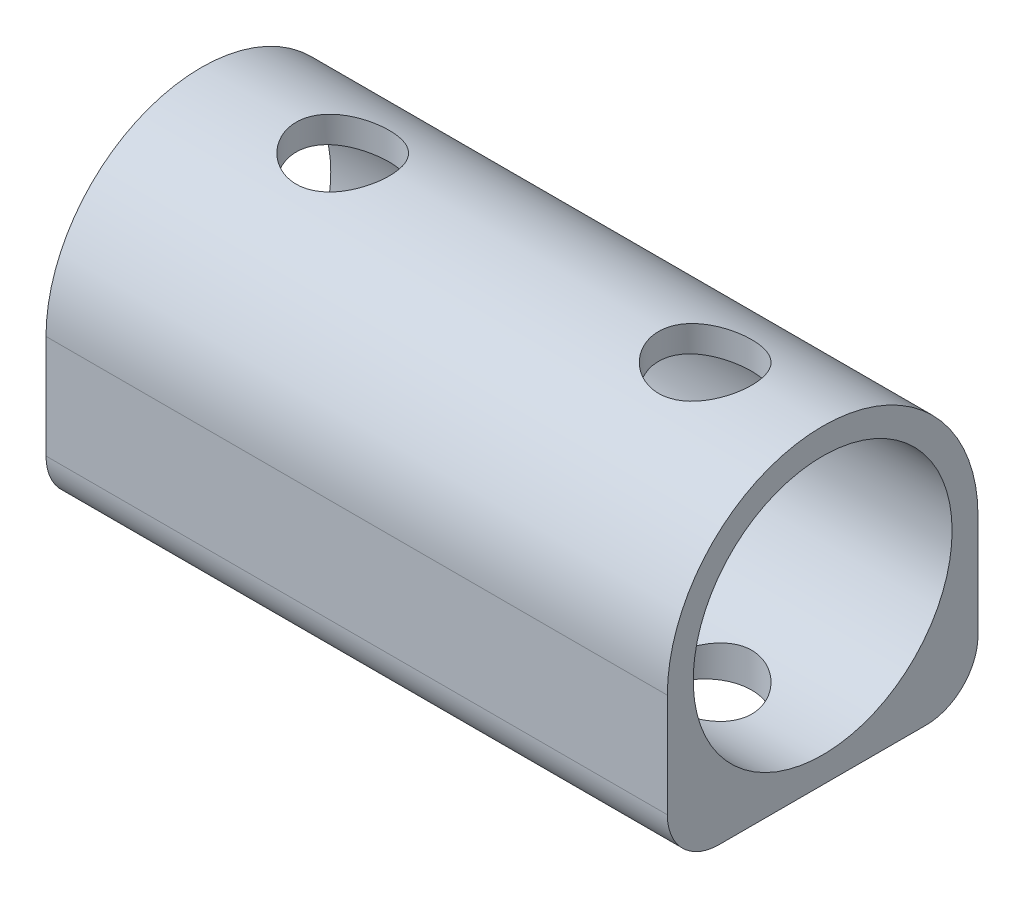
ISO-10303-21;
HEADER;
FILE_DESCRIPTION(('STEP AP214'),'2;1');
FILE_NAME('part.step','',(''),(''),'','','');
FILE_SCHEMA(('AUTOMOTIVE_DESIGN { 1 0 10303 214 1 1 1 1 }'));
ENDSEC;
DATA;
#1=APPLICATION_CONTEXT('core data for automotive mechanical design processes');
#2=APPLICATION_PROTOCOL_DEFINITION('international standard','automotive_design',2000,#1);
#3=PRODUCT_CONTEXT('',#1,'mechanical');
#4=PRODUCT('Part','Part','',(#3));
#5=PRODUCT_RELATED_PRODUCT_CATEGORY('part','',(#4));
#6=PRODUCT_DEFINITION_FORMATION('','',#4);
#7=PRODUCT_DEFINITION_CONTEXT('part definition',#1,'design');
#8=PRODUCT_DEFINITION('design','',#6,#7);
#9=PRODUCT_DEFINITION_SHAPE('','',#8);
#10=(LENGTH_UNIT() NAMED_UNIT(*) SI_UNIT(.MILLI.,.METRE.));
#11=(NAMED_UNIT(*) PLANE_ANGLE_UNIT() SI_UNIT($,.RADIAN.));
#12=(NAMED_UNIT(*) SI_UNIT($,.STERADIAN.) SOLID_ANGLE_UNIT());
#13=UNCERTAINTY_MEASURE_WITH_UNIT(LENGTH_MEASURE(1.E-05),#10,'distance_accuracy_value','');
#14=(GEOMETRIC_REPRESENTATION_CONTEXT(3) GLOBAL_UNCERTAINTY_ASSIGNED_CONTEXT((#13)) GLOBAL_UNIT_ASSIGNED_CONTEXT((#10,
#11,#12)) REPRESENTATION_CONTEXT('',''));
#15=CARTESIAN_POINT('',(0.,0.,0.));
#16=DIRECTION('',(0.,0.,1.));
#17=DIRECTION('',(1.,0.,0.));
#18=AXIS2_PLACEMENT_3D('',#15,#16,#17);
#19=CARTESIAN_POINT('',(-76.2,-19.05,19.05));
#20=DIRECTION('',(0.,-1.,0.));
#21=DIRECTION('',(0.,0.,-1.));
#22=AXIS2_PLACEMENT_3D('',#19,#20,#21);
#23=PLANE('',#22);
#24=CARTESIAN_POINT('',(-58.8598189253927,-19.05,0.));
#25=DIRECTION('',(0.,-1.,0.));
#26=DIRECTION('',(1.,0.,0.));
#27=AXIS2_PLACEMENT_3D('',#24,#25,#26);
#28=CIRCLE('',#27,5.715);
#29=CARTESIAN_POINT('',(-53.1448189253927,-19.05,0.));
#30=VERTEX_POINT('',#29);
#31=EDGE_CURVE('E166',#30,#30,#28,.T.);
#32=ORIENTED_EDGE('',*,*,#31,.F.);
#33=EDGE_LOOP('',(#32));
#34=FACE_BOUND('',#33,.T.);
#35=CARTESIAN_POINT('',(-14.4098189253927,-19.05,0.));
#36=DIRECTION('',(0.,-1.,0.));
#37=DIRECTION('',(1.,0.,0.));
#38=AXIS2_PLACEMENT_3D('',#35,#36,#37);
#39=CIRCLE('',#38,5.715);
#40=CARTESIAN_POINT('',(-8.69481892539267,-19.05,0.));
#41=VERTEX_POINT('',#40);
#42=EDGE_CURVE('E123',#41,#41,#39,.T.);
#43=ORIENTED_EDGE('',*,*,#42,.F.);
#44=EDGE_LOOP('',(#43));
#45=FACE_BOUND('',#44,.T.);
#46=DIRECTION('',(0.,0.,-1.));
#47=VECTOR('',#46,1.);
#48=CARTESIAN_POINT('',(0.,-19.05,19.05));
#49=LINE('',#48,#47);
#50=CARTESIAN_POINT('',(0.,-19.05,12.7));
#51=VERTEX_POINT('',#50);
#52=CARTESIAN_POINT('',(0.,-19.05,-12.7));
#53=VERTEX_POINT('',#52);
#54=EDGE_CURVE('E98',#51,#53,#49,.T.);
#55=ORIENTED_EDGE('',*,*,#54,.F.);
#56=DIRECTION('',(1.,0.,0.));
#57=VECTOR('',#56,1.);
#58=CARTESIAN_POINT('',(-76.2,-19.05,12.7));
#59=LINE('',#58,#57);
#60=CARTESIAN_POINT('',(-76.2,-19.05,12.7));
#61=VERTEX_POINT('',#60);
#62=EDGE_CURVE('E189',#51,#61,#59,.F.);
#63=ORIENTED_EDGE('',*,*,#62,.T.);
#64=DIRECTION('',(0.,0.,-1.));
#65=VECTOR('',#64,1.);
#66=CARTESIAN_POINT('',(-76.2,-19.05,19.05));
#67=LINE('',#66,#65);
#68=CARTESIAN_POINT('',(-76.2,-19.05,-12.7));
#69=VERTEX_POINT('',#68);
#70=EDGE_CURVE('E103',#61,#69,#67,.T.);
#71=ORIENTED_EDGE('',*,*,#70,.T.);
#72=DIRECTION('',(1.,0.,0.));
#73=VECTOR('',#72,1.);
#74=CARTESIAN_POINT('',(0.,-19.05,-12.7));
#75=LINE('',#74,#73);
#76=EDGE_CURVE('E186',#69,#53,#75,.T.);
#77=ORIENTED_EDGE('',*,*,#76,.T.);
#78=EDGE_LOOP('',(#55,#63,#71,#77));
#79=FACE_BOUND('',#78,.T.);
#80=ADVANCED_FACE('F28',(#34,#45,#79),#23,.T.);
#81=CARTESIAN_POINT('',(-76.2,0.,19.05));
#82=DIRECTION('',(0.,0.,1.));
#83=DIRECTION('',(0.,-1.,0.));
#84=AXIS2_PLACEMENT_3D('',#81,#82,#83);
#85=PLANE('',#84);
#86=DIRECTION('',(0.,-1.,0.));
#87=VECTOR('',#86,1.);
#88=CARTESIAN_POINT('',(-76.2,0.,19.05));
#89=LINE('',#88,#87);
#90=CARTESIAN_POINT('',(-76.2,0.,19.05));
#91=VERTEX_POINT('',#90);
#92=CARTESIAN_POINT('',(-76.2,-12.7,19.05));
#93=VERTEX_POINT('',#92);
#94=EDGE_CURVE('E88',#91,#93,#89,.T.);
#95=ORIENTED_EDGE('',*,*,#94,.T.);
#96=DIRECTION('',(1.,0.,0.));
#97=VECTOR('',#96,1.);
#98=CARTESIAN_POINT('',(-76.2,-12.7,19.05));
#99=LINE('',#98,#97);
#100=CARTESIAN_POINT('',(0.,-12.7,19.05));
#101=VERTEX_POINT('',#100);
#102=EDGE_CURVE('E113',#93,#101,#99,.T.);
#103=ORIENTED_EDGE('',*,*,#102,.T.);
#104=DIRECTION('',(0.,-1.,0.));
#105=VECTOR('',#104,1.);
#106=CARTESIAN_POINT('',(0.,0.,19.05));
#107=LINE('',#106,#105);
#108=CARTESIAN_POINT('',(0.,0.,19.05));
#109=VERTEX_POINT('',#108);
#110=EDGE_CURVE('E101',#109,#101,#107,.T.);
#111=ORIENTED_EDGE('',*,*,#110,.F.);
#112=DIRECTION('',(1.,0.,0.));
#113=VECTOR('',#112,1.);
#114=CARTESIAN_POINT('',(-76.2,0.,19.05));
#115=LINE('',#114,#113);
#116=EDGE_CURVE('E87',#91,#109,#115,.T.);
#117=ORIENTED_EDGE('',*,*,#116,.F.);
#118=EDGE_LOOP('',(#95,#103,#111,#117));
#119=FACE_BOUND('',#118,.T.);
#120=ADVANCED_FACE('F156',(#119),#85,.T.);
#121=CARTESIAN_POINT('',(-76.2,0.,0.));
#122=DIRECTION('',(1.,0.,0.));
#123=DIRECTION('',(0.,0.,-1.));
#124=AXIS2_PLACEMENT_3D('',#121,#122,#123);
#125=CYLINDRICAL_SURFACE('',#124,19.05);
#126=CARTESIAN_POINT('',(-53.1448189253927,19.05,0.));
#127=CARTESIAN_POINT('',(-53.144808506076,19.0500060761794,-0.156828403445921));
#128=CARTESIAN_POINT('',(-53.1512757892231,19.0480600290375,-0.313561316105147));
#129=CARTESIAN_POINT('',(-53.1770354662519,19.0403558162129,-0.625895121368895));
#130=CARTESIAN_POINT('',(-53.1963287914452,19.0345973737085,-0.781495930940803));
#131=CARTESIAN_POINT('',(-53.2732869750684,19.0117860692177,-1.24487741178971));
#132=CARTESIAN_POINT('',(-53.3500302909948,18.9891969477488,-1.54944591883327));
#133=CARTESIAN_POINT('',(-53.5515163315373,18.9317233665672,-2.14024264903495));
#134=CARTESIAN_POINT('',(-53.6761882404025,18.8968570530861,-2.42649720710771));
#135=CARTESIAN_POINT('',(-53.9698513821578,18.8184247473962,-2.97419892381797));
#136=CARTESIAN_POINT('',(-54.1388485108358,18.7748575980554,-3.23564277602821));
#137=CARTESIAN_POINT('',(-54.4243149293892,18.7057791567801,-3.6073396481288));
#138=CARTESIAN_POINT('',(-54.526335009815,18.6817964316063,-3.72926292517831));
#139=CARTESIAN_POINT('',(-54.7401086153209,18.6333692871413,-3.96413732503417));
#140=CARTESIAN_POINT('',(-54.8518588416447,18.6089250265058,-4.07709146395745));
#141=CARTESIAN_POINT('',(-55.0844504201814,18.5602194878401,-4.29337423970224));
#142=CARTESIAN_POINT('',(-55.2052965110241,18.5359583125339,-4.39669779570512));
#143=CARTESIAN_POINT('',(-55.4552375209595,18.48830463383,-4.59296033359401));
#144=CARTESIAN_POINT('',(-55.5843293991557,18.4649118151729,-4.68590310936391));
#145=CARTESIAN_POINT('',(-55.8530503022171,18.4191207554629,-4.86282171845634));
#146=CARTESIAN_POINT('',(-55.9928531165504,18.3967576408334,-4.94654293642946));
#147=CARTESIAN_POINT('',(-56.2793110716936,18.3542977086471,-5.10183656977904));
#148=CARTESIAN_POINT('',(-56.4259635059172,18.3342000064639,-5.17341373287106));
#149=CARTESIAN_POINT('',(-56.7251993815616,18.2968805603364,-5.30389205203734));
#150=CARTESIAN_POINT('',(-56.8777841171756,18.2796594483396,-5.36279042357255));
#151=CARTESIAN_POINT('',(-57.1876933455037,18.2486581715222,-5.46735324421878));
#152=CARTESIAN_POINT('',(-57.3450157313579,18.2348765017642,-5.51302348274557));
#153=CARTESIAN_POINT('',(-57.6588828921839,18.2115268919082,-5.58966451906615));
#154=CARTESIAN_POINT('',(-57.8153292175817,18.2018531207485,-5.62100633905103));
#155=CARTESIAN_POINT('',(-58.1304264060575,18.1864933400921,-5.67050559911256));
#156=CARTESIAN_POINT('',(-58.2890763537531,18.1808057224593,-5.68866835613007));
#157=CARTESIAN_POINT('',(-58.6074317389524,18.1735976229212,-5.71165433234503));
#158=CARTESIAN_POINT('',(-58.767137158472,18.1720770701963,-5.71647777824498));
#159=CARTESIAN_POINT('',(-59.086373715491,18.1732530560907,-5.71273820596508));
#160=CARTESIAN_POINT('',(-59.2459048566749,18.1759495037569,-5.70417547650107));
#161=CARTESIAN_POINT('',(-59.5577908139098,18.1852970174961,-5.67430210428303));
#162=CARTESIAN_POINT('',(-59.7101957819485,18.1918008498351,-5.65346590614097));
#163=CARTESIAN_POINT('',(-60.012689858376,18.2084477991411,-5.59961803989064));
#164=CARTESIAN_POINT('',(-60.1627781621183,18.2185921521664,-5.56660223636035));
#165=CARTESIAN_POINT('',(-60.459519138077,18.2422160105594,-5.48868917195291));
#166=CARTESIAN_POINT('',(-60.6061728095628,18.2556945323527,-5.44379541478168));
#167=CARTESIAN_POINT('',(-60.8951840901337,18.2856040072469,-5.34246904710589));
#168=CARTESIAN_POINT('',(-61.0375400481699,18.3020360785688,-5.28603206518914));
#169=CARTESIAN_POINT('',(-61.3188767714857,18.3376257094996,-5.1612252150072));
#170=CARTESIAN_POINT('',(-61.4577874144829,18.3568166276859,-5.09270654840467));
#171=CARTESIAN_POINT('',(-61.7293898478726,18.3972183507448,-4.94476887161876));
#172=CARTESIAN_POINT('',(-61.8620793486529,18.4184298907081,-4.86534588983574));
#173=CARTESIAN_POINT('',(-62.2495452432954,18.4842334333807,-4.61152372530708));
#174=CARTESIAN_POINT('',(-62.4939397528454,18.5310236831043,-4.42147298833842));
#175=CARTESIAN_POINT('',(-62.9582267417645,18.6275149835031,-3.99595392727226));
#176=CARTESIAN_POINT('',(-63.1766697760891,18.6772559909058,-3.75892036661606));
#177=CARTESIAN_POINT('',(-63.5710779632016,18.7723350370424,-3.25093924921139));
#178=CARTESIAN_POINT('',(-63.7470404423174,18.8176727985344,-2.97998955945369));
#179=CARTESIAN_POINT('',(-64.0523183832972,18.8992447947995,-2.4092710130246));
#180=CARTESIAN_POINT('',(-64.1813135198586,18.9354160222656,-2.10932128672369));
#181=CARTESIAN_POINT('',(-64.3866025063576,18.9941270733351,-1.49064547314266));
#182=CARTESIAN_POINT('',(-64.4629110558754,19.0166706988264,-1.17192464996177));
#183=CARTESIAN_POINT('',(-64.5582539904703,19.0449847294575,-0.537027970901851));
#184=CARTESIAN_POINT('',(-64.5792448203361,19.0513278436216,-0.221170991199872));
#185=CARTESIAN_POINT('',(-64.5688401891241,19.0482063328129,0.409573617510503));
#186=CARTESIAN_POINT('',(-64.5374517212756,19.0387438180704,0.724461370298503));
#187=CARTESIAN_POINT('',(-64.4247642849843,19.0054496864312,1.33694219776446));
#188=CARTESIAN_POINT('',(-64.3446084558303,18.9819473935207,1.63476524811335));
#189=CARTESIAN_POINT('',(-64.1380255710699,18.923292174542,2.21267719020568));
#190=CARTESIAN_POINT('',(-64.0115929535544,18.8881378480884,2.49276394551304));
#191=CARTESIAN_POINT('',(-63.7128044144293,18.8088156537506,3.03441799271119));
#192=CARTESIAN_POINT('',(-63.5394537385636,18.7644580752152,3.29540693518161));
#193=CARTESIAN_POINT('',(-63.1527947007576,18.6717922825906,3.78535285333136));
#194=CARTESIAN_POINT('',(-62.9394763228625,18.6234830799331,4.01430177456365));
#195=CARTESIAN_POINT('',(-62.5896108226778,18.5509821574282,4.33313873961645));
#196=CARTESIAN_POINT('',(-62.4655274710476,18.5263732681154,4.43692169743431));
#197=CARTESIAN_POINT('',(-62.2089054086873,18.4781436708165,4.6336750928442));
#198=CARTESIAN_POINT('',(-62.0763697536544,18.4545226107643,4.72664940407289));
#199=CARTESIAN_POINT('',(-61.8036354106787,18.408944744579,4.90116314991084));
#200=CARTESIAN_POINT('',(-61.6634337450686,18.3869885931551,4.98269809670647));
#201=CARTESIAN_POINT('',(-61.3763885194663,18.3454148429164,5.13365192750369));
#202=CARTESIAN_POINT('',(-61.2295477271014,18.3257962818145,5.20307580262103));
#203=CARTESIAN_POINT('',(-60.9308177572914,18.2895715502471,5.32901034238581));
#204=CARTESIAN_POINT('',(-60.778952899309,18.2729528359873,5.38557504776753));
#205=CARTESIAN_POINT('',(-60.4707182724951,18.2431564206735,5.48566061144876));
#206=CARTESIAN_POINT('',(-60.3143503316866,18.2299773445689,5.52918668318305));
#207=CARTESIAN_POINT('',(-59.9982248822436,18.2074817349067,5.6028201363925));
#208=CARTESIAN_POINT('',(-59.8384676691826,18.198164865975,5.63292868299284));
#209=CARTESIAN_POINT('',(-59.5167850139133,18.1837033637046,5.67943906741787));
#210=CARTESIAN_POINT('',(-59.3548596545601,18.1785585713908,5.69584142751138));
#211=CARTESIAN_POINT('',(-59.036927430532,18.1727390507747,5.71438037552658));
#212=CARTESIAN_POINT('',(-58.8809567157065,18.1718861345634,5.71708566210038));
#213=CARTESIAN_POINT('',(-58.5692908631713,18.1741957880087,5.70973930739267));
#214=CARTESIAN_POINT('',(-58.4135958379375,18.1773597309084,5.69968330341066));
#215=CARTESIAN_POINT('',(-58.103742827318,18.1876044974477,5.66690706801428));
#216=CARTESIAN_POINT('',(-57.9495842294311,18.1946836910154,5.64419210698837));
#217=CARTESIAN_POINT('',(-57.6437859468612,18.2125424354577,5.58629700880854));
#218=CARTESIAN_POINT('',(-57.4921472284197,18.2233233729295,5.55111220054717));
#219=CARTESIAN_POINT('',(-57.1944277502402,18.2480978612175,5.46911617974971));
#220=CARTESIAN_POINT('',(-57.0483006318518,18.2620483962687,5.4224600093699));
#221=CARTESIAN_POINT('',(-56.7604841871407,18.2928400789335,5.31765770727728));
#222=CARTESIAN_POINT('',(-56.6187964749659,18.3096822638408,5.25950745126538));
#223=CARTESIAN_POINT('',(-56.3408256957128,18.3457791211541,5.13217916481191));
#224=CARTESIAN_POINT('',(-56.2045414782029,18.3650332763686,5.06300349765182));
#225=CARTESIAN_POINT('',(-55.9381125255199,18.405441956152,4.91407779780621));
#226=CARTESIAN_POINT('',(-55.8079701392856,18.4265971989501,4.83432376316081));
#227=CARTESIAN_POINT('',(-55.5500525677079,18.4710345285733,4.66171658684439));
#228=CARTESIAN_POINT('',(-55.422532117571,18.4943658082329,4.56849470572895));
#229=CARTESIAN_POINT('',(-55.1757068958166,18.5418248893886,4.37189558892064));
#230=CARTESIAN_POINT('',(-55.0564052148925,18.5659529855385,4.26851456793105));
#231=CARTESIAN_POINT('',(-54.7120075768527,18.638543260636,3.94413638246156));
#232=CARTESIAN_POINT('',(-54.5002150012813,18.6872481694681,3.70876720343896));
#233=CARTESIAN_POINT('',(-54.1124103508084,18.7814419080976,3.19828026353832));
#234=CARTESIAN_POINT('',(-53.9376253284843,18.8267950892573,2.92220162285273));
#235=CARTESIAN_POINT('',(-53.712368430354,18.8873597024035,2.48829970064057));
#236=CARTESIAN_POINT('',(-53.643423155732,18.9063076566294,2.34032747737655));
#237=CARTESIAN_POINT('',(-53.5183227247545,18.9412045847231,2.03869263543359));
#238=CARTESIAN_POINT('',(-53.4621666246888,18.9571537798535,1.88503043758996));
#239=CARTESIAN_POINT('',(-53.368487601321,18.9840512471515,1.58991480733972));
#240=CARTESIAN_POINT('',(-53.3296114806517,18.9953525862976,1.44892179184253));
#241=CARTESIAN_POINT('',(-53.2627348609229,19.014931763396,1.16417669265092));
#242=CARTESIAN_POINT('',(-53.2347370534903,19.0232088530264,1.02042393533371));
#243=CARTESIAN_POINT('',(-53.1674725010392,19.0431621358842,0.586389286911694));
#244=CARTESIAN_POINT('',(-53.1448383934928,19.049988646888,0.293027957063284));
#245=CARTESIAN_POINT('',(-53.1448189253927,19.05,0.));
#246=B_SPLINE_CURVE_WITH_KNOTS('',3,(#126,#127,#128,#129,#130,#131,#132,#133,#134,#135,#136,
#137,#138,#139,#140,#141,#142,#143,#144,#145,#146,#147,#148,#149,#150,#151,#152,#153,#154,#155,
#156,#157,#158,#159,#160,#161,#162,#163,#164,#165,#166,#167,#168,#169,#170,#171,#172,#173,#174,
#175,#176,#177,#178,#179,#180,#181,#182,#183,#184,#185,#186,#187,#188,#189,#190,#191,#192,#193,
#194,#195,#196,#197,#198,#199,#200,#201,#202,#203,#204,#205,#206,#207,#208,#209,#210,#211,#212,
#213,#214,#215,#216,#217,#218,#219,#220,#221,#222,#223,#224,#225,#226,#227,#228,#229,#230,#231,
#232,#233,#234,#235,#236,#237,#238,#239,#240,#241,#242,#243,#244,#245),.UNSPECIFIED.,.T.,.F.,(4,
2,2,2,2,2,2,2,2,2,2,2,2,2,2,2,2,2,2,2,2,2,2,2,2,2,2,2,2,2,2,2,2,2,2,2,2,2,2,2,2,2,2,2,2,2,2,2,2,
2,2,2,2,2,2,2,2,2,2,4),(0.,0.470156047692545,0.940346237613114,1.88010849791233,2.8184875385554,
3.75699145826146,4.23886808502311,4.72058197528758,5.20254858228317,5.68433846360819,
6.17718071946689,6.66982985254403,7.16258707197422,7.65512830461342,8.13407105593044,
8.61282047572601,9.09156175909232,9.57029271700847,10.0316309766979,10.4931260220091,
10.9544850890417,11.4160191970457,11.8836949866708,12.351541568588,13.2865130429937,
14.2605297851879,15.2346078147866,16.2152100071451,17.1955385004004,18.1406987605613,
19.0857328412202,20.0094251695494,20.9332285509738,21.8784038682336,22.82381636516,
23.3142118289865,23.8044309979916,24.2948419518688,24.7850503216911,25.2731588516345,
25.7610719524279,26.2489426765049,26.7367948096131,27.2042150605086,27.6717951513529,
28.1391807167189,28.6067415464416,29.0683004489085,29.5300252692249,29.991651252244,
30.4534523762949,30.9319118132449,31.4105502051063,32.3670906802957,33.35159549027,
33.8441032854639,34.3365747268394,34.77617411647,35.2158822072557,36.0943510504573),.UNSPECIFIED.);
#247=CARTESIAN_POINT('',(-53.1448189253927,19.05,0.));
#248=VERTEX_POINT('',#247);
#249=EDGE_CURVE('E160',#248,#248,#246,.T.);
#250=ORIENTED_EDGE('',*,*,#249,.F.);
#251=EDGE_LOOP('',(#250));
#252=FACE_BOUND('',#251,.T.);
#253=CARTESIAN_POINT('',(-8.69481892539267,19.05,0.));
#254=CARTESIAN_POINT('',(-8.69480850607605,19.0500060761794,-0.156828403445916));
#255=CARTESIAN_POINT('',(-8.70127578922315,19.0480600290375,-0.313561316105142));
#256=CARTESIAN_POINT('',(-8.7270354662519,19.0403558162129,-0.62589512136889));
#257=CARTESIAN_POINT('',(-8.74632879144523,19.0345973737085,-0.781495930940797));
#258=CARTESIAN_POINT('',(-8.82328697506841,19.0117860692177,-1.24487741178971));
#259=CARTESIAN_POINT('',(-8.90003029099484,18.9891969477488,-1.54944591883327));
#260=CARTESIAN_POINT('',(-9.10151633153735,18.9317233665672,-2.14024264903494));
#261=CARTESIAN_POINT('',(-9.22618824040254,18.8968570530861,-2.42649720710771));
#262=CARTESIAN_POINT('',(-9.51985138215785,18.8184247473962,-2.97419892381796));
#263=CARTESIAN_POINT('',(-9.68884851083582,18.7748575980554,-3.23564277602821));
#264=CARTESIAN_POINT('',(-9.97431492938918,18.7057791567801,-3.6073396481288));
#265=CARTESIAN_POINT('',(-10.076335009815,18.6817964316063,-3.7292629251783));
#266=CARTESIAN_POINT('',(-10.2901086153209,18.6333692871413,-3.96413732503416));
#267=CARTESIAN_POINT('',(-10.4018588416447,18.6089250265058,-4.07709146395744));
#268=CARTESIAN_POINT('',(-10.6344504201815,18.5602194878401,-4.29337423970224));
#269=CARTESIAN_POINT('',(-10.7552965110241,18.5359583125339,-4.39669779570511));
#270=CARTESIAN_POINT('',(-11.0052375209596,18.48830463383,-4.592960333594));
#271=CARTESIAN_POINT('',(-11.1343293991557,18.4649118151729,-4.68590310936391));
#272=CARTESIAN_POINT('',(-11.4030503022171,18.4191207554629,-4.86282171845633));
#273=CARTESIAN_POINT('',(-11.5428531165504,18.3967576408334,-4.94654293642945));
#274=CARTESIAN_POINT('',(-11.8293110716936,18.3542977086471,-5.10183656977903));
#275=CARTESIAN_POINT('',(-11.9759635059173,18.3342000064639,-5.17341373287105));
#276=CARTESIAN_POINT('',(-12.2751993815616,18.2968805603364,-5.30389205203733));
#277=CARTESIAN_POINT('',(-12.4277841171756,18.2796594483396,-5.36279042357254));
#278=CARTESIAN_POINT('',(-12.7376933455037,18.2486581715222,-5.46735324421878));
#279=CARTESIAN_POINT('',(-12.8950157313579,18.2348765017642,-5.51302348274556));
#280=CARTESIAN_POINT('',(-13.2088828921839,18.2115268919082,-5.58966451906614));
#281=CARTESIAN_POINT('',(-13.3653292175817,18.2018531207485,-5.62100633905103));
#282=CARTESIAN_POINT('',(-13.6804264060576,18.1864933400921,-5.67050559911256));
#283=CARTESIAN_POINT('',(-13.8390763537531,18.1808057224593,-5.68866835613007));
#284=CARTESIAN_POINT('',(-14.1574317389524,18.1735976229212,-5.71165433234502));
#285=CARTESIAN_POINT('',(-14.3171371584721,18.1720770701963,-5.71647777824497));
#286=CARTESIAN_POINT('',(-14.636373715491,18.1732530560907,-5.71273820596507));
#287=CARTESIAN_POINT('',(-14.7959048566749,18.1759495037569,-5.70417547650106));
#288=CARTESIAN_POINT('',(-15.1077908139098,18.1852970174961,-5.67430210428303));
#289=CARTESIAN_POINT('',(-15.2601957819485,18.1918008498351,-5.65346590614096));
#290=CARTESIAN_POINT('',(-15.562689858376,18.2084477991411,-5.59961803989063));
#291=CARTESIAN_POINT('',(-15.7127781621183,18.2185921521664,-5.56660223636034));
#292=CARTESIAN_POINT('',(-16.009519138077,18.2422160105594,-5.4886891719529));
#293=CARTESIAN_POINT('',(-16.1561728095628,18.2556945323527,-5.44379541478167));
#294=CARTESIAN_POINT('',(-16.4451840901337,18.2856040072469,-5.34246904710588));
#295=CARTESIAN_POINT('',(-16.5875400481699,18.3020360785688,-5.28603206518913));
#296=CARTESIAN_POINT('',(-16.8688767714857,18.3376257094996,-5.1612252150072));
#297=CARTESIAN_POINT('',(-17.0077874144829,18.3568166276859,-5.09270654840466));
#298=CARTESIAN_POINT('',(-17.2793898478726,18.3972183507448,-4.94476887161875));
#299=CARTESIAN_POINT('',(-17.4120793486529,18.4184298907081,-4.86534588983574));
#300=CARTESIAN_POINT('',(-17.7995452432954,18.4842334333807,-4.61152372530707));
#301=CARTESIAN_POINT('',(-18.0439397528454,18.5310236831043,-4.42147298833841));
#302=CARTESIAN_POINT('',(-18.5082267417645,18.6275149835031,-3.99595392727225));
#303=CARTESIAN_POINT('',(-18.7266697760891,18.6772559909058,-3.75892036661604));
#304=CARTESIAN_POINT('',(-19.1210779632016,18.7723350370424,-3.25093924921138));
#305=CARTESIAN_POINT('',(-19.2970404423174,18.8176727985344,-2.97998955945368));
#306=CARTESIAN_POINT('',(-19.6023183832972,18.8992447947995,-2.40927101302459));
#307=CARTESIAN_POINT('',(-19.7313135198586,18.9354160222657,-2.10932128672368));
#308=CARTESIAN_POINT('',(-19.9366025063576,18.9941270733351,-1.49064547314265));
#309=CARTESIAN_POINT('',(-20.0129110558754,19.0166706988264,-1.17192464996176));
#310=CARTESIAN_POINT('',(-20.1082539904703,19.0449847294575,-0.537027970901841));
#311=CARTESIAN_POINT('',(-20.1292448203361,19.0513278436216,-0.221170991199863));
#312=CARTESIAN_POINT('',(-20.1188401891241,19.0482063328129,0.40957361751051));
#313=CARTESIAN_POINT('',(-20.0874517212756,19.0387438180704,0.724461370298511));
#314=CARTESIAN_POINT('',(-19.9747642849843,19.0054496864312,1.33694219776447));
#315=CARTESIAN_POINT('',(-19.8946084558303,18.9819473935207,1.63476524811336));
#316=CARTESIAN_POINT('',(-19.6880255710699,18.923292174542,2.21267719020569));
#317=CARTESIAN_POINT('',(-19.5615929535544,18.8881378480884,2.49276394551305));
#318=CARTESIAN_POINT('',(-19.2628044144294,18.8088156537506,3.0344179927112));
#319=CARTESIAN_POINT('',(-19.0894537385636,18.7644580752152,3.29540693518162));
#320=CARTESIAN_POINT('',(-18.7027947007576,18.6717922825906,3.78535285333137));
#321=CARTESIAN_POINT('',(-18.4894763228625,18.6234830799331,4.01430177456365));
#322=CARTESIAN_POINT('',(-18.1396108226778,18.5509821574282,4.33313873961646));
#323=CARTESIAN_POINT('',(-18.0155274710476,18.5263732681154,4.43692169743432));
#324=CARTESIAN_POINT('',(-17.7589054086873,18.4781436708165,4.63367509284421));
#325=CARTESIAN_POINT('',(-17.6263697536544,18.4545226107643,4.7266494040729));
#326=CARTESIAN_POINT('',(-17.3536354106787,18.408944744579,4.90116314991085));
#327=CARTESIAN_POINT('',(-17.2134337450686,18.3869885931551,4.98269809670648));
#328=CARTESIAN_POINT('',(-16.9263885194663,18.3454148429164,5.1336519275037));
#329=CARTESIAN_POINT('',(-16.7795477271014,18.3257962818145,5.20307580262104));
#330=CARTESIAN_POINT('',(-16.4808177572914,18.2895715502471,5.32901034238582));
#331=CARTESIAN_POINT('',(-16.328952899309,18.2729528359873,5.38557504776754));
#332=CARTESIAN_POINT('',(-16.020718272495,18.2431564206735,5.48566061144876));
#333=CARTESIAN_POINT('',(-15.8643503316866,18.2299773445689,5.52918668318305));
#334=CARTESIAN_POINT('',(-15.5482248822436,18.2074817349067,5.6028201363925));
#335=CARTESIAN_POINT('',(-15.3884676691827,18.198164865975,5.63292868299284));
#336=CARTESIAN_POINT('',(-15.0667850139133,18.1837033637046,5.67943906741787));
#337=CARTESIAN_POINT('',(-14.9048596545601,18.1785585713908,5.69584142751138));
#338=CARTESIAN_POINT('',(-14.586927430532,18.1727390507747,5.71438037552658));
#339=CARTESIAN_POINT('',(-14.4309567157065,18.1718861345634,5.71708566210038));
#340=CARTESIAN_POINT('',(-14.1192908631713,18.1741957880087,5.70973930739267));
#341=CARTESIAN_POINT('',(-13.9635958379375,18.1773597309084,5.69968330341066));
#342=CARTESIAN_POINT('',(-13.653742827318,18.1876044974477,5.66690706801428));
#343=CARTESIAN_POINT('',(-13.4995842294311,18.1946836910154,5.64419210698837));
#344=CARTESIAN_POINT('',(-13.1937859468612,18.2125424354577,5.58629700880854));
#345=CARTESIAN_POINT('',(-13.0421472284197,18.2233233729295,5.55111220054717));
#346=CARTESIAN_POINT('',(-12.7444277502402,18.2480978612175,5.46911617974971));
#347=CARTESIAN_POINT('',(-12.5983006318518,18.2620483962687,5.4224600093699));
#348=CARTESIAN_POINT('',(-12.3104841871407,18.2928400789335,5.31765770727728));
#349=CARTESIAN_POINT('',(-12.1687964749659,18.3096822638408,5.25950745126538));
#350=CARTESIAN_POINT('',(-11.8908256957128,18.3457791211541,5.13217916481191));
#351=CARTESIAN_POINT('',(-11.7545414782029,18.3650332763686,5.06300349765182));
#352=CARTESIAN_POINT('',(-11.4881125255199,18.405441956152,4.91407779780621));
#353=CARTESIAN_POINT('',(-11.3579701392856,18.4265971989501,4.83432376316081));
#354=CARTESIAN_POINT('',(-11.1000525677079,18.4710345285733,4.66171658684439));
#355=CARTESIAN_POINT('',(-10.972532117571,18.4943658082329,4.56849470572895));
#356=CARTESIAN_POINT('',(-10.7257068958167,18.5418248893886,4.37189558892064));
#357=CARTESIAN_POINT('',(-10.6064052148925,18.5659529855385,4.26851456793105));
#358=CARTESIAN_POINT('',(-10.2620075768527,18.638543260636,3.94413638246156));
#359=CARTESIAN_POINT('',(-10.0502150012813,18.6872481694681,3.70876720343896));
#360=CARTESIAN_POINT('',(-9.66241035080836,18.7814419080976,3.19828026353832));
#361=CARTESIAN_POINT('',(-9.48762532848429,18.8267950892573,2.92220162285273));
#362=CARTESIAN_POINT('',(-9.26236843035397,18.8873597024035,2.48829970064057));
#363=CARTESIAN_POINT('',(-9.19342315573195,18.9063076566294,2.34032747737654));
#364=CARTESIAN_POINT('',(-9.06832272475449,18.9412045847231,2.03869263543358));
#365=CARTESIAN_POINT('',(-9.01216662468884,18.9571537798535,1.88503043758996));
#366=CARTESIAN_POINT('',(-8.91848760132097,18.9840512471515,1.58991480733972));
#367=CARTESIAN_POINT('',(-8.87961148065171,18.9953525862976,1.44892179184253));
#368=CARTESIAN_POINT('',(-8.81273486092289,19.014931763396,1.16417669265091));
#369=CARTESIAN_POINT('',(-8.7847370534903,19.0232088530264,1.0204239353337));
#370=CARTESIAN_POINT('',(-8.71747250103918,19.0431621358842,0.586389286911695));
#371=CARTESIAN_POINT('',(-8.69483839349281,19.049988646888,0.293027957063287));
#372=CARTESIAN_POINT('',(-8.69481892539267,19.05,0.));
#373=B_SPLINE_CURVE_WITH_KNOTS('',3,(#253,#254,#255,#256,#257,#258,#259,#260,#261,#262,#263,
#264,#265,#266,#267,#268,#269,#270,#271,#272,#273,#274,#275,#276,#277,#278,#279,#280,#281,#282,
#283,#284,#285,#286,#287,#288,#289,#290,#291,#292,#293,#294,#295,#296,#297,#298,#299,#300,#301,
#302,#303,#304,#305,#306,#307,#308,#309,#310,#311,#312,#313,#314,#315,#316,#317,#318,#319,#320,
#321,#322,#323,#324,#325,#326,#327,#328,#329,#330,#331,#332,#333,#334,#335,#336,#337,#338,#339,
#340,#341,#342,#343,#344,#345,#346,#347,#348,#349,#350,#351,#352,#353,#354,#355,#356,#357,#358,
#359,#360,#361,#362,#363,#364,#365,#366,#367,#368,#369,#370,#371,#372),.UNSPECIFIED.,.T.,.F.,(4,
2,2,2,2,2,2,2,2,2,2,2,2,2,2,2,2,2,2,2,2,2,2,2,2,2,2,2,2,2,2,2,2,2,2,2,2,2,2,2,2,2,2,2,2,2,2,2,2,
2,2,2,2,2,2,2,2,2,2,4),(0.,0.470156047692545,0.940346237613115,1.88010849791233,2.8184875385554,
3.75699145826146,4.2388680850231,4.72058197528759,5.20254858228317,5.68433846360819,
6.17718071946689,6.66982985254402,7.16258707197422,7.65512830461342,8.13407105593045,
8.61282047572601,9.09156175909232,9.57029271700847,10.0316309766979,10.4931260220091,
10.9544850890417,11.4160191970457,11.8836949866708,12.351541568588,13.2865130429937,
14.2605297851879,15.2346078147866,16.2152100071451,17.1955385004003,18.1406987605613,
19.0857328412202,20.0094251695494,20.9332285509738,21.8784038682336,22.82381636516,
23.3142118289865,23.8044309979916,24.2948419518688,24.7850503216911,25.2731588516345,
25.7610719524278,26.2489426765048,26.7367948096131,27.2042150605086,27.6717951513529,
28.1391807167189,28.6067415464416,29.0683004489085,29.5300252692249,29.991651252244,
30.4534523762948,30.9319118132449,31.4105502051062,32.3670906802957,33.35159549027,
33.8441032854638,34.3365747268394,34.77617411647,35.2158822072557,36.0943510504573),.UNSPECIFIED.);
#374=CARTESIAN_POINT('',(-8.69481892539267,19.05,0.));
#375=VERTEX_POINT('',#374);
#376=EDGE_CURVE('E143',#375,#375,#373,.T.);
#377=ORIENTED_EDGE('',*,*,#376,.F.);
#378=EDGE_LOOP('',(#377));
#379=FACE_BOUND('',#378,.T.);
#380=CARTESIAN_POINT('',(0.,0.,0.));
#381=DIRECTION('',(1.,0.,0.));
#382=DIRECTION('',(0.,0.,-1.));
#383=AXIS2_PLACEMENT_3D('',#380,#381,#382);
#384=CIRCLE('',#383,19.05);
#385=CARTESIAN_POINT('',(0.,0.,-19.05));
#386=VERTEX_POINT('',#385);
#387=EDGE_CURVE('E94',#386,#109,#384,.T.);
#388=ORIENTED_EDGE('',*,*,#387,.F.);
#389=DIRECTION('',(1.,0.,0.));
#390=VECTOR('',#389,1.);
#391=CARTESIAN_POINT('',(-76.2,0.,-19.05));
#392=LINE('',#391,#390);
#393=CARTESIAN_POINT('',(-76.2,0.,-19.05));
#394=VERTEX_POINT('',#393);
#395=EDGE_CURVE('E78',#394,#386,#392,.T.);
#396=ORIENTED_EDGE('',*,*,#395,.F.);
#397=CARTESIAN_POINT('',(-76.2,0.,0.));
#398=DIRECTION('',(1.,0.,0.));
#399=DIRECTION('',(0.,0.,-1.));
#400=AXIS2_PLACEMENT_3D('',#397,#398,#399);
#401=CIRCLE('',#400,19.05);
#402=EDGE_CURVE('E109',#394,#91,#401,.T.);
#403=ORIENTED_EDGE('',*,*,#402,.T.);
#404=ORIENTED_EDGE('',*,*,#116,.T.);
#405=EDGE_LOOP('',(#388,#396,#403,#404));
#406=FACE_BOUND('',#405,.T.);
#407=ADVANCED_FACE('F100',(#252,#379,#406),#125,.T.);
#408=CARTESIAN_POINT('',(-76.2,0.,-19.05));
#409=DIRECTION('',(0.,0.,1.));
#410=DIRECTION('',(0.,-1.,0.));
#411=AXIS2_PLACEMENT_3D('',#408,#409,#410);
#412=PLANE('',#411);
#413=DIRECTION('',(0.,-1.,0.));
#414=VECTOR('',#413,1.);
#415=CARTESIAN_POINT('',(0.,0.,-19.05));
#416=LINE('',#415,#414);
#417=CARTESIAN_POINT('',(0.,-12.7,-19.05));
#418=VERTEX_POINT('',#417);
#419=EDGE_CURVE('E81',#386,#418,#416,.T.);
#420=ORIENTED_EDGE('',*,*,#419,.T.);
#421=DIRECTION('',(1.,0.,0.));
#422=VECTOR('',#421,1.);
#423=CARTESIAN_POINT('',(-76.2,-12.7,-19.05));
#424=LINE('',#423,#422);
#425=CARTESIAN_POINT('',(-76.2,-12.7,-19.05));
#426=VERTEX_POINT('',#425);
#427=EDGE_CURVE('E11',#418,#426,#424,.F.);
#428=ORIENTED_EDGE('',*,*,#427,.T.);
#429=DIRECTION('',(0.,-1.,0.));
#430=VECTOR('',#429,1.);
#431=CARTESIAN_POINT('',(-76.2,0.,-19.05));
#432=LINE('',#431,#430);
#433=EDGE_CURVE('E82',#394,#426,#432,.T.);
#434=ORIENTED_EDGE('',*,*,#433,.F.);
#435=ORIENTED_EDGE('',*,*,#395,.T.);
#436=EDGE_LOOP('',(#420,#428,#434,#435));
#437=FACE_BOUND('',#436,.T.);
#438=ADVANCED_FACE('F80',(#437),#412,.F.);
#439=CARTESIAN_POINT('',(-76.2,0.,0.));
#440=DIRECTION('',(1.,0.,0.));
#441=DIRECTION('',(0.,0.,-1.));
#442=AXIS2_PLACEMENT_3D('',#439,#440,#441);
#443=PLANE('',#442);
#444=CARTESIAN_POINT('',(-76.2,0.,0.));
#445=DIRECTION('',(1.,0.,0.));
#446=DIRECTION('',(0.,0.,-1.));
#447=AXIS2_PLACEMENT_3D('',#444,#445,#446);
#448=CIRCLE('',#447,15.875);
#449=CARTESIAN_POINT('',(-76.2,0.,-15.875));
#450=VERTEX_POINT('',#449);
#451=EDGE_CURVE('E202',#450,#450,#448,.T.);
#452=ORIENTED_EDGE('',*,*,#451,.T.);
#453=EDGE_LOOP('',(#452));
#454=FACE_BOUND('',#453,.T.);
#455=ORIENTED_EDGE('',*,*,#70,.F.);
#456=CARTESIAN_POINT('',(-76.2,-12.7,12.7));
#457=DIRECTION('',(1.,0.,0.));
#458=DIRECTION('',(0.,0.,-1.));
#459=AXIS2_PLACEMENT_3D('',#456,#457,#458);
#460=CIRCLE('',#459,6.35);
#461=EDGE_CURVE('E35',#61,#93,#460,.F.);
#462=ORIENTED_EDGE('',*,*,#461,.T.);
#463=ORIENTED_EDGE('',*,*,#94,.F.);
#464=ORIENTED_EDGE('',*,*,#402,.F.);
#465=ORIENTED_EDGE('',*,*,#433,.T.);
#466=CARTESIAN_POINT('',(-76.2,-12.7,-12.7));
#467=DIRECTION('',(1.,0.,0.));
#468=DIRECTION('',(0.,0.,-1.));
#469=AXIS2_PLACEMENT_3D('',#466,#467,#468);
#470=CIRCLE('',#469,6.35);
#471=EDGE_CURVE('E47',#426,#69,#470,.F.);
#472=ORIENTED_EDGE('',*,*,#471,.T.);
#473=EDGE_LOOP('',(#455,#462,#463,#464,#465,#472));
#474=FACE_BOUND('',#473,.T.);
#475=ADVANCED_FACE('F193',(#454,#474),#443,.F.);
#476=CARTESIAN_POINT('',(0.,0.,0.));
#477=DIRECTION('',(1.,0.,0.));
#478=DIRECTION('',(0.,0.,-1.));
#479=AXIS2_PLACEMENT_3D('',#476,#477,#478);
#480=PLANE('',#479);
#481=CARTESIAN_POINT('',(0.,0.,0.));
#482=DIRECTION('',(1.,0.,0.));
#483=DIRECTION('',(0.,0.,-1.));
#484=AXIS2_PLACEMENT_3D('',#481,#482,#483);
#485=CIRCLE('',#484,15.875);
#486=CARTESIAN_POINT('',(0.,0.,-15.875));
#487=VERTEX_POINT('',#486);
#488=EDGE_CURVE('E150',#487,#487,#485,.T.);
#489=ORIENTED_EDGE('',*,*,#488,.F.);
#490=EDGE_LOOP('',(#489));
#491=FACE_BOUND('',#490,.T.);
#492=ORIENTED_EDGE('',*,*,#110,.T.);
#493=CARTESIAN_POINT('',(0.,-12.7,12.7));
#494=DIRECTION('',(1.,0.,0.));
#495=DIRECTION('',(0.,0.,-1.));
#496=AXIS2_PLACEMENT_3D('',#493,#494,#495);
#497=CIRCLE('',#496,6.35);
#498=EDGE_CURVE('E184',#101,#51,#497,.T.);
#499=ORIENTED_EDGE('',*,*,#498,.T.);
#500=ORIENTED_EDGE('',*,*,#54,.T.);
#501=CARTESIAN_POINT('',(0.,-12.7,-12.7));
#502=DIRECTION('',(1.,0.,0.));
#503=DIRECTION('',(0.,0.,-1.));
#504=AXIS2_PLACEMENT_3D('',#501,#502,#503);
#505=CIRCLE('',#504,6.35);
#506=EDGE_CURVE('E97',#53,#418,#505,.T.);
#507=ORIENTED_EDGE('',*,*,#506,.T.);
#508=ORIENTED_EDGE('',*,*,#419,.F.);
#509=ORIENTED_EDGE('',*,*,#387,.T.);
#510=EDGE_LOOP('',(#492,#499,#500,#507,#508,#509));
#511=FACE_BOUND('',#510,.T.);
#512=ADVANCED_FACE('F93',(#491,#511),#480,.T.);
#513=CARTESIAN_POINT('',(-76.2,0.,0.));
#514=DIRECTION('',(1.,0.,0.));
#515=DIRECTION('',(0.,0.,-1.));
#516=AXIS2_PLACEMENT_3D('',#513,#514,#515);
#517=CYLINDRICAL_SURFACE('',#516,15.875);
#518=CARTESIAN_POINT('',(-53.1448189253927,15.875,0.));
#519=CARTESIAN_POINT('',(-53.144818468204,15.8750003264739,-0.155149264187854));
#520=CARTESIAN_POINT('',(-53.1511417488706,15.8727205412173,-0.310291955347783));
#521=CARTESIAN_POINT('',(-53.1763743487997,15.8636629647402,-0.619472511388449));
#522=CARTESIAN_POINT('',(-53.1952878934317,15.8568836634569,-0.773509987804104));
#523=CARTESIAN_POINT('',(-53.2455076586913,15.8390132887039,-1.0792221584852));
#524=CARTESIAN_POINT('',(-53.2768083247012,15.827924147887,-1.2308978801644));
#525=CARTESIAN_POINT('',(-53.3515200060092,15.8017256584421,-1.53094084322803));
#526=CARTESIAN_POINT('',(-53.3949357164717,15.7866147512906,-1.67930677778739));
#527=CARTESIAN_POINT('',(-53.4933715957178,15.7528101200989,-1.97133410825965));
#528=CARTESIAN_POINT('',(-53.5483653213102,15.7341245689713,-2.11500537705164));
#529=CARTESIAN_POINT('',(-53.6695810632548,15.6936199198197,-2.39713118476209));
#530=CARTESIAN_POINT('',(-53.7358072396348,15.6717996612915,-2.53558376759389));
#531=CARTESIAN_POINT('',(-53.878953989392,15.6255825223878,-2.80636049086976));
#532=CARTESIAN_POINT('',(-53.955872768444,15.6011860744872,-2.93868565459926));
#533=CARTESIAN_POINT('',(-54.1199007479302,15.5504064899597,-3.19652263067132));
#534=CARTESIAN_POINT('',(-54.2070136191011,15.5240226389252,-3.32203196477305));
#535=CARTESIAN_POINT('',(-54.3941144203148,15.4689573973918,-3.56982614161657));
#536=CARTESIAN_POINT('',(-54.4944498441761,15.4402276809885,-3.69183795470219));
#537=CARTESIAN_POINT('',(-54.7047802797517,15.3820848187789,-3.92705646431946));
#538=CARTESIAN_POINT('',(-54.8147755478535,15.352671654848,-4.04026292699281));
#539=CARTESIAN_POINT('',(-55.0438112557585,15.2939223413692,-4.25725335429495));
#540=CARTESIAN_POINT('',(-55.1628555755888,15.264586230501,-4.36103323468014));
#541=CARTESIAN_POINT('',(-55.4092116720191,15.2067997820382,-4.55844738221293));
#542=CARTESIAN_POINT('',(-55.536520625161,15.1783491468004,-4.65208508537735));
#543=CARTESIAN_POINT('',(-55.8033042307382,15.1221392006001,-4.83173885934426));
#544=CARTESIAN_POINT('',(-55.9430487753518,15.0944389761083,-4.91737326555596));
#545=CARTESIAN_POINT('',(-56.2297059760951,15.0416774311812,-5.07647423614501));
#546=CARTESIAN_POINT('',(-56.3766157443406,15.0166150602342,-5.14994565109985));
#547=CARTESIAN_POINT('',(-56.6767000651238,14.9699179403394,-5.28414935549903));
#548=CARTESIAN_POINT('',(-56.829875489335,14.9482836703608,-5.34487986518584));
#549=CARTESIAN_POINT('',(-57.1413111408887,14.9091858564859,-5.45299091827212));
#550=CARTESIAN_POINT('',(-57.299568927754,14.891720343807,-5.50037776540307));
#551=CARTESIAN_POINT('',(-57.6139379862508,14.8621354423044,-5.57981034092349));
#552=CARTESIAN_POINT('',(-57.7699026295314,14.8498382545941,-5.61237021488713));
#553=CARTESIAN_POINT('',(-58.0842435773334,14.8300818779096,-5.66436871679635));
#554=CARTESIAN_POINT('',(-58.2426188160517,14.8226206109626,-5.6838129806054));
#555=CARTESIAN_POINT('',(-58.5605800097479,14.8127882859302,-5.70938847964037));
#556=CARTESIAN_POINT('',(-58.7201658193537,14.8104166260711,-5.71552128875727));
#557=CARTESIAN_POINT('',(-59.0392809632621,14.810845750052,-5.71440938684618));
#558=CARTESIAN_POINT('',(-59.1988102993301,14.8136463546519,-5.70716513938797));
#559=CARTESIAN_POINT('',(-59.5078300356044,14.8240272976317,-5.6801436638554));
#560=CARTESIAN_POINT('',(-59.6573920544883,14.8313376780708,-5.661073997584));
#561=CARTESIAN_POINT('',(-59.9543273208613,14.8502655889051,-5.61123399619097));
#562=CARTESIAN_POINT('',(-60.1016998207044,14.861884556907,-5.58045975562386));
#563=CARTESIAN_POINT('',(-60.3931738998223,14.8890739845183,-5.50750515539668));
#564=CARTESIAN_POINT('',(-60.5372763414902,14.9046433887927,-5.46532784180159));
#565=CARTESIAN_POINT('',(-60.821392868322,14.9392864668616,-5.36990869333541));
#566=CARTESIAN_POINT('',(-60.961405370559,14.9583614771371,-5.31666263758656));
#567=CARTESIAN_POINT('',(-61.2388685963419,14.9998376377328,-5.19850768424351));
#568=CARTESIAN_POINT('',(-61.3762312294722,15.0222912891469,-5.13341049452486));
#569=CARTESIAN_POINT('',(-61.6450539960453,15.0696522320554,-4.99266649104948));
#570=CARTESIAN_POINT('',(-61.7765120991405,15.0945603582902,-4.91701608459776));
#571=CARTESIAN_POINT('',(-62.0327681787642,15.1461629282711,-4.7556854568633));
#572=CARTESIAN_POINT('',(-62.1575655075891,15.1728575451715,-4.67000426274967));
#573=CARTESIAN_POINT('',(-62.3998254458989,15.2273475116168,-4.48914594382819));
#574=CARTESIAN_POINT('',(-62.5172877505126,15.2551429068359,-4.39396842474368));
#575=CARTESIAN_POINT('',(-62.751269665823,15.3128753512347,-4.18850209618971));
#576=CARTESIAN_POINT('',(-62.86728262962,15.3428386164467,-4.07764296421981));
#577=CARTESIAN_POINT('',(-63.0895887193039,15.4023986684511,-3.84655316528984));
#578=CARTESIAN_POINT('',(-63.1958848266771,15.4319955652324,-3.72632539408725));
#579=CARTESIAN_POINT('',(-63.3981680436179,15.4900490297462,-3.47712225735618));
#580=CARTESIAN_POINT('',(-63.4941498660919,15.518505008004,-3.34814246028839));
#581=CARTESIAN_POINT('',(-63.6750395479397,15.5734814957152,-3.08232216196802));
#582=CARTESIAN_POINT('',(-63.7599518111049,15.6000027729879,-2.94548481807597));
#583=CARTESIAN_POINT('',(-63.9191928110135,15.650747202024,-2.66282417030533));
#584=CARTESIAN_POINT('',(-63.9933602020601,15.674933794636,-2.51690327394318));
#585=CARTESIAN_POINT('',(-64.1290427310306,15.7198925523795,-2.21885206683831));
#586=CARTESIAN_POINT('',(-64.1905628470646,15.7406660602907,-2.06672422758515));
#587=CARTESIAN_POINT('',(-64.3004089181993,15.7782050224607,-1.7573136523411));
#588=CARTESIAN_POINT('',(-64.3487365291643,15.7949709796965,-1.60003156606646));
#589=CARTESIAN_POINT('',(-64.4317195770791,15.8239995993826,-1.28149572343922));
#590=CARTESIAN_POINT('',(-64.4663757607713,15.8362625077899,-1.12024218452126));
#591=CARTESIAN_POINT('',(-64.5202770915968,15.8554276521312,-0.803124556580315));
#592=CARTESIAN_POINT('',(-64.5402013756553,15.8625656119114,-0.647389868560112));
#593=CARTESIAN_POINT('',(-64.5671693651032,15.8722427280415,-0.334669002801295));
#594=CARTESIAN_POINT('',(-64.5742135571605,15.8747820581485,-0.177682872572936));
#595=CARTESIAN_POINT('',(-64.5753494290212,15.8751909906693,0.136313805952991));
#596=CARTESIAN_POINT('',(-64.5694433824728,15.8730614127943,0.293324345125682));
#597=CARTESIAN_POINT('',(-64.5447442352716,15.8641937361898,0.606195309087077));
#598=CARTESIAN_POINT('',(-64.5259513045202,15.8574556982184,0.762055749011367));
#599=CARTESIAN_POINT('',(-64.4765521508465,15.8398731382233,1.0660235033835));
#600=CARTESIAN_POINT('',(-64.4463833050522,15.8291809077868,1.21421103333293));
#601=CARTESIAN_POINT('',(-64.3744864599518,15.8039496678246,1.50747043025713));
#602=CARTESIAN_POINT('',(-64.332754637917,15.7894093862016,1.65254124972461));
#603=CARTESIAN_POINT('',(-64.2381068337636,15.7568527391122,1.93853740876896));
#604=CARTESIAN_POINT('',(-64.1851938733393,15.7388373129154,2.07946385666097));
#605=CARTESIAN_POINT('',(-64.0685790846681,15.699763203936,2.35640105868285));
#606=CARTESIAN_POINT('',(-64.0048731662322,15.6787033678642,2.49240992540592));
#607=CARTESIAN_POINT('',(-63.865224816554,15.6334258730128,2.76240470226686));
#608=CARTESIAN_POINT('',(-63.7889893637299,15.6091362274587,2.89622695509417));
#609=CARTESIAN_POINT('',(-63.6261485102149,15.5584803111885,3.15705143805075));
#610=CARTESIAN_POINT('',(-63.5395395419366,15.5321133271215,3.2840512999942));
#611=CARTESIAN_POINT('',(-63.3565310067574,15.4779578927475,3.53049071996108));
#612=CARTESIAN_POINT('',(-63.2601301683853,15.4501692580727,3.64992929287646));
#613=CARTESIAN_POINT('',(-63.0581342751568,15.3938573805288,3.8805767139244));
#614=CARTESIAN_POINT('',(-62.9525389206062,15.3653341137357,3.99178529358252));
#615=CARTESIAN_POINT('',(-62.7268638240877,15.3067285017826,4.21108677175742));
#616=CARTESIAN_POINT('',(-62.6063110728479,15.2766445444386,4.3186930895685));
#617=CARTESIAN_POINT('',(-62.3564501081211,15.2172964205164,4.52336913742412));
#618=CARTESIAN_POINT('',(-62.2271447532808,15.1880319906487,4.62044228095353));
#619=CARTESIAN_POINT('',(-61.9604599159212,15.1311400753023,4.80347968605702));
#620=CARTESIAN_POINT('',(-61.8230766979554,15.1035133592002,4.88943874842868));
#621=CARTESIAN_POINT('',(-61.5411979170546,15.0507487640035,5.04952376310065));
#622=CARTESIAN_POINT('',(-61.3967053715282,15.0256098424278,5.12365467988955));
#623=CARTESIAN_POINT('',(-61.1011914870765,14.9785458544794,5.25965601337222));
#624=CARTESIAN_POINT('',(-60.9501576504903,14.956627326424,5.3215015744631));
#625=CARTESIAN_POINT('',(-60.6429415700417,14.9167940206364,5.43215812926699));
#626=CARTESIAN_POINT('',(-60.4867615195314,14.8988775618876,5.48097459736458));
#627=CARTESIAN_POINT('',(-60.1703919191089,14.8676573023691,5.56510625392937));
#628=CARTESIAN_POINT('',(-60.0102033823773,14.8543523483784,5.60042481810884));
#629=CARTESIAN_POINT('',(-59.687052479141,14.8328262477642,5.65719158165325));
#630=CARTESIAN_POINT('',(-59.5240902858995,14.824604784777,5.6786406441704));
#631=CARTESIAN_POINT('',(-59.2065343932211,14.8138769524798,5.70656473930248));
#632=CARTESIAN_POINT('',(-59.0520226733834,14.8110583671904,5.71385813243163));
#633=CARTESIAN_POINT('',(-58.742848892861,14.8102728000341,5.71589426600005));
#634=CARTESIAN_POINT('',(-58.5881867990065,14.8123074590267,5.71063276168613));
#635=CARTESIAN_POINT('',(-58.28000796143,14.8211627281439,5.68761029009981));
#636=CARTESIAN_POINT('',(-58.1264907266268,14.8279811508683,5.66985503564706));
#637=CARTESIAN_POINT('',(-57.8216054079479,14.8461820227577,5.62202434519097));
#638=CARTESIAN_POINT('',(-57.670238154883,14.8575661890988,5.5919442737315));
#639=CARTESIAN_POINT('',(-57.3747344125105,14.8841792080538,5.5207098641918));
#640=CARTESIAN_POINT('',(-57.2305124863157,14.8992988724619,5.47986815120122));
#641=CARTESIAN_POINT('',(-56.9460469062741,14.9330829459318,5.38712292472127));
#642=CARTESIAN_POINT('',(-56.80580467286,14.9517486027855,5.33521551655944));
#643=CARTESIAN_POINT('',(-56.5302033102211,14.9920956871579,5.22076331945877));
#644=CARTESIAN_POINT('',(-56.39484337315,15.0137766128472,5.15822030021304));
#645=CARTESIAN_POINT('',(-56.1297238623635,15.0595730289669,5.02294570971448));
#646=CARTESIAN_POINT('',(-55.999966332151,15.0836893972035,4.95021046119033));
#647=CARTESIAN_POINT('',(-55.6077829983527,15.1612171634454,4.70981789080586));
#648=CARTESIAN_POINT('',(-55.355917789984,15.2177516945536,4.52553847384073));
#649=CARTESIAN_POINT('',(-54.8856765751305,15.3328413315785,4.11875245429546));
#650=CARTESIAN_POINT('',(-54.6673108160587,15.3913970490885,3.89623419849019));
#651=CARTESIAN_POINT('',(-54.3639897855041,15.4776253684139,3.53205238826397));
#652=CARTESIAN_POINT('',(-54.2649550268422,15.5067485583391,3.40222681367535));
#653=CARTESIAN_POINT('',(-54.0781978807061,15.5631093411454,3.13431892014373));
#654=CARTESIAN_POINT('',(-53.9904713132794,15.5903476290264,2.99623967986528));
#655=CARTESIAN_POINT('',(-53.8269637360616,15.6421870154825,2.71263759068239));
#656=CARTESIAN_POINT('',(-53.7511875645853,15.666787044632,2.56711175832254));
#657=CARTESIAN_POINT('',(-53.6122872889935,15.7126283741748,2.26970413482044));
#658=CARTESIAN_POINT('',(-53.549157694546,15.7338711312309,2.11782513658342));
#659=CARTESIAN_POINT('',(-53.4354833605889,15.7726005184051,1.80706300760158));
#660=CARTESIAN_POINT('',(-53.3850823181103,15.7900439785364,1.64812183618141));
#661=CARTESIAN_POINT('',(-53.2983007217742,15.8203422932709,1.32609734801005));
#662=CARTESIAN_POINT('',(-53.2619141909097,15.8331991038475,1.16301582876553));
#663=CARTESIAN_POINT('',(-53.203532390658,15.8539342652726,0.834001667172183));
#664=CARTESIAN_POINT('',(-53.1815354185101,15.861813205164,0.668069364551));
#665=CARTESIAN_POINT('',(-53.1521794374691,15.8723457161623,0.334755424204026));
#666=CARTESIAN_POINT('',(-53.1448194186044,15.8749996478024,0.167373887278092));
#667=CARTESIAN_POINT('',(-53.1448189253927,15.875,0.));
#668=B_SPLINE_CURVE_WITH_KNOTS('',3,(#518,#519,#520,#521,#522,#523,#524,#525,#526,#527,#528,
#529,#530,#531,#532,#533,#534,#535,#536,#537,#538,#539,#540,#541,#542,#543,#544,#545,#546,#547,
#548,#549,#550,#551,#552,#553,#554,#555,#556,#557,#558,#559,#560,#561,#562,#563,#564,#565,#566,
#567,#568,#569,#570,#571,#572,#573,#574,#575,#576,#577,#578,#579,#580,#581,#582,#583,#584,#585,
#586,#587,#588,#589,#590,#591,#592,#593,#594,#595,#596,#597,#598,#599,#600,#601,#602,#603,#604,
#605,#606,#607,#608,#609,#610,#611,#612,#613,#614,#615,#616,#617,#618,#619,#620,#621,#622,#623,
#624,#625,#626,#627,#628,#629,#630,#631,#632,#633,#634,#635,#636,#637,#638,#639,#640,#641,#642,
#643,#644,#645,#646,#647,#648,#649,#650,#651,#652,#653,#654,#655,#656,#657,#658,#659,#660,#661,
#662,#663,#664,#665,#666,#667),.UNSPECIFIED.,.T.,.F.,(4,2,2,2,2,2,2,2,2,2,2,2,2,2,2,2,2,2,2,2,2,
2,2,2,2,2,2,2,2,2,2,2,2,2,2,2,2,2,2,2,2,2,2,2,2,2,2,2,2,2,2,2,2,2,2,2,2,2,2,2,2,2,2,2,2,2,2,2,2,
2,2,2,2,2,4),(0.,0.465291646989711,0.930739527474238,1.39597892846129,1.8613988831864,
2.32576717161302,2.79030781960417,3.25477060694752,3.71940115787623,4.20054090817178,
4.68169343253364,5.16305344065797,5.64424985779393,6.14229498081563,6.64014100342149,
7.13805652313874,7.63573642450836,8.11452103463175,8.59309977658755,9.0716219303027,
9.55012750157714,10.0024468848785,10.4549173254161,10.9072670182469,11.3597895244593,
11.8202542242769,12.2808760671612,12.7415426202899,13.2022283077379,13.6913775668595,
14.1803762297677,14.6696243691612,15.158677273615,15.6544458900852,16.1500189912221,
16.645529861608,17.141013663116,17.6119210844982,18.0828107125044,18.5536176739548,
19.0244184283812,19.4787092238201,19.9331503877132,20.38746889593,20.8419599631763,
21.3091948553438,21.7765908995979,22.244047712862,22.7115197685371,23.2040508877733,
23.6964219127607,24.1890224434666,24.6814156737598,25.1747951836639,25.6679670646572,
26.1610155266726,26.65403330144,27.1175838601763,27.5812911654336,28.0447865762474,
28.5084564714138,28.9599111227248,29.4115249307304,29.8630636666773,30.3147657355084,
31.2618253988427,32.2091741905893,32.7062546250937,33.2031507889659,33.7002476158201,
34.1971281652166,34.6993898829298,35.2014371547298,35.7034250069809,36.2053782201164),.UNSPECIFIED.);
#669=CARTESIAN_POINT('',(-53.1448189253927,15.875,0.));
#670=VERTEX_POINT('',#669);
#671=EDGE_CURVE('E165',#670,#670,#668,.T.);
#672=ORIENTED_EDGE('',*,*,#671,.T.);
#673=EDGE_LOOP('',(#672));
#674=FACE_BOUND('',#673,.T.);
#675=CARTESIAN_POINT('',(-53.1448189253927,-15.875,0.));
#676=CARTESIAN_POINT('',(-53.144818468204,-15.8750003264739,0.155149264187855));
#677=CARTESIAN_POINT('',(-53.1511417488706,-15.8727205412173,0.310291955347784));
#678=CARTESIAN_POINT('',(-53.1763743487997,-15.8636629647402,0.61947251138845));
#679=CARTESIAN_POINT('',(-53.1952878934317,-15.8568836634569,0.773509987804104));
#680=CARTESIAN_POINT('',(-53.2455076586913,-15.8390132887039,1.0792221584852));
#681=CARTESIAN_POINT('',(-53.2768083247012,-15.827924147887,1.23089788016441));
#682=CARTESIAN_POINT('',(-53.3515200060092,-15.8017256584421,1.53094084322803));
#683=CARTESIAN_POINT('',(-53.3949357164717,-15.7866147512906,1.67930677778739));
#684=CARTESIAN_POINT('',(-53.4933715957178,-15.7528101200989,1.97133410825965));
#685=CARTESIAN_POINT('',(-53.5483653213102,-15.7341245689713,2.11500537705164));
#686=CARTESIAN_POINT('',(-53.6695810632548,-15.6936199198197,2.39713118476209));
#687=CARTESIAN_POINT('',(-53.7358072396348,-15.6717996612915,2.53558376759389));
#688=CARTESIAN_POINT('',(-53.878953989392,-15.6255825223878,2.80636049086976));
#689=CARTESIAN_POINT('',(-53.955872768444,-15.6011860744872,2.93868565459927));
#690=CARTESIAN_POINT('',(-54.1199007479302,-15.5504064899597,3.19652263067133));
#691=CARTESIAN_POINT('',(-54.2070136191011,-15.5240226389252,3.32203196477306));
#692=CARTESIAN_POINT('',(-54.3941144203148,-15.4689573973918,3.56982614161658));
#693=CARTESIAN_POINT('',(-54.4944498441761,-15.4402276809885,3.6918379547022));
#694=CARTESIAN_POINT('',(-54.7047802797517,-15.3820848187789,3.92705646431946));
#695=CARTESIAN_POINT('',(-54.8147755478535,-15.352671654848,4.04026292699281));
#696=CARTESIAN_POINT('',(-55.0438112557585,-15.2939223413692,4.25725335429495));
#697=CARTESIAN_POINT('',(-55.1628555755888,-15.264586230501,4.36103323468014));
#698=CARTESIAN_POINT('',(-55.4092116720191,-15.2067997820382,4.55844738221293));
#699=CARTESIAN_POINT('',(-55.536520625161,-15.1783491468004,4.65208508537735));
#700=CARTESIAN_POINT('',(-55.8033042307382,-15.1221392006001,4.83173885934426));
#701=CARTESIAN_POINT('',(-55.9430487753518,-15.0944389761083,4.91737326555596));
#702=CARTESIAN_POINT('',(-56.2297059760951,-15.0416774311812,5.07647423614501));
#703=CARTESIAN_POINT('',(-56.3766157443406,-15.0166150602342,5.14994565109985));
#704=CARTESIAN_POINT('',(-56.6767000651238,-14.9699179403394,5.28414935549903));
#705=CARTESIAN_POINT('',(-56.829875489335,-14.9482836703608,5.34487986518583));
#706=CARTESIAN_POINT('',(-57.1413111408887,-14.9091858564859,5.45299091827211));
#707=CARTESIAN_POINT('',(-57.2995689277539,-14.891720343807,5.50037776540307));
#708=CARTESIAN_POINT('',(-57.6139379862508,-14.8621354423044,5.57981034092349));
#709=CARTESIAN_POINT('',(-57.7699026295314,-14.8498382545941,5.61237021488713));
#710=CARTESIAN_POINT('',(-58.0842435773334,-14.8300818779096,5.66436871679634));
#711=CARTESIAN_POINT('',(-58.2426188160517,-14.8226206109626,5.68381298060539));
#712=CARTESIAN_POINT('',(-58.5605800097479,-14.8127882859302,5.70938847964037));
#713=CARTESIAN_POINT('',(-58.7201658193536,-14.8104166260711,5.71552128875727));
#714=CARTESIAN_POINT('',(-59.0392809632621,-14.810845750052,5.71440938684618));
#715=CARTESIAN_POINT('',(-59.1988102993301,-14.8136463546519,5.70716513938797));
#716=CARTESIAN_POINT('',(-59.5078300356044,-14.8240272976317,5.6801436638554));
#717=CARTESIAN_POINT('',(-59.6573920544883,-14.8313376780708,5.661073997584));
#718=CARTESIAN_POINT('',(-59.9543273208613,-14.8502655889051,5.61123399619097));
#719=CARTESIAN_POINT('',(-60.1016998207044,-14.861884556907,5.58045975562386));
#720=CARTESIAN_POINT('',(-60.3931738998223,-14.8890739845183,5.50750515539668));
#721=CARTESIAN_POINT('',(-60.5372763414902,-14.9046433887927,5.46532784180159));
#722=CARTESIAN_POINT('',(-60.8213928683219,-14.9392864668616,5.36990869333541));
#723=CARTESIAN_POINT('',(-60.961405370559,-14.9583614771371,5.31666263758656));
#724=CARTESIAN_POINT('',(-61.2388685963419,-14.9998376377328,5.19850768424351));
#725=CARTESIAN_POINT('',(-61.3762312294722,-15.0222912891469,5.13341049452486));
#726=CARTESIAN_POINT('',(-61.6450539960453,-15.0696522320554,4.99266649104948));
#727=CARTESIAN_POINT('',(-61.7765120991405,-15.0945603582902,4.91701608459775));
#728=CARTESIAN_POINT('',(-62.0327681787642,-15.1461629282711,4.7556854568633));
#729=CARTESIAN_POINT('',(-62.1575655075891,-15.1728575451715,4.67000426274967));
#730=CARTESIAN_POINT('',(-62.3998254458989,-15.2273475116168,4.48914594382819));
#731=CARTESIAN_POINT('',(-62.5172877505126,-15.2551429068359,4.39396842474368));
#732=CARTESIAN_POINT('',(-62.751269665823,-15.3128753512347,4.18850209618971));
#733=CARTESIAN_POINT('',(-62.86728262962,-15.3428386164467,4.07764296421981));
#734=CARTESIAN_POINT('',(-63.0895887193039,-15.4023986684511,3.84655316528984));
#735=CARTESIAN_POINT('',(-63.1958848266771,-15.4319955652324,3.72632539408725));
#736=CARTESIAN_POINT('',(-63.3981680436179,-15.4900490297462,3.47712225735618));
#737=CARTESIAN_POINT('',(-63.4941498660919,-15.518505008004,3.34814246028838));
#738=CARTESIAN_POINT('',(-63.6750395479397,-15.5734814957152,3.08232216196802));
#739=CARTESIAN_POINT('',(-63.7599518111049,-15.6000027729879,2.94548481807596));
#740=CARTESIAN_POINT('',(-63.9191928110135,-15.650747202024,2.66282417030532));
#741=CARTESIAN_POINT('',(-63.9933602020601,-15.674933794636,2.51690327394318));
#742=CARTESIAN_POINT('',(-64.1290427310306,-15.7198925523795,2.21885206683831));
#743=CARTESIAN_POINT('',(-64.1905628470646,-15.7406660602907,2.06672422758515));
#744=CARTESIAN_POINT('',(-64.3004089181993,-15.7782050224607,1.75731365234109));
#745=CARTESIAN_POINT('',(-64.3487365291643,-15.7949709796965,1.60003156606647));
#746=CARTESIAN_POINT('',(-64.4317195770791,-15.8239995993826,1.28149572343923));
#747=CARTESIAN_POINT('',(-64.4663757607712,-15.8362625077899,1.12024218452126));
#748=CARTESIAN_POINT('',(-64.5202770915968,-15.8554276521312,0.803124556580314));
#749=CARTESIAN_POINT('',(-64.5402013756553,-15.8625656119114,0.647389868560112));
#750=CARTESIAN_POINT('',(-64.5671693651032,-15.8722427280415,0.334669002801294));
#751=CARTESIAN_POINT('',(-64.5742135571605,-15.8747820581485,0.177682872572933));
#752=CARTESIAN_POINT('',(-64.5753494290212,-15.8751909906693,-0.136313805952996));
#753=CARTESIAN_POINT('',(-64.5694433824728,-15.8730614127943,-0.293324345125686));
#754=CARTESIAN_POINT('',(-64.5447442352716,-15.8641937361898,-0.60619530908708));
#755=CARTESIAN_POINT('',(-64.5259513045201,-15.8574556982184,-0.762055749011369));
#756=CARTESIAN_POINT('',(-64.4765521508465,-15.8398731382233,-1.0660235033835));
#757=CARTESIAN_POINT('',(-64.4463833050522,-15.8291809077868,-1.21421103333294));
#758=CARTESIAN_POINT('',(-64.3744864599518,-15.8039496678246,-1.50747043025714));
#759=CARTESIAN_POINT('',(-64.332754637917,-15.7894093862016,-1.65254124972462));
#760=CARTESIAN_POINT('',(-64.2381068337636,-15.7568527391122,-1.93853740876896));
#761=CARTESIAN_POINT('',(-64.1851938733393,-15.7388373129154,-2.07946385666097));
#762=CARTESIAN_POINT('',(-64.0685790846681,-15.699763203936,-2.35640105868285));
#763=CARTESIAN_POINT('',(-64.0048731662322,-15.6787033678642,-2.49240992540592));
#764=CARTESIAN_POINT('',(-63.865224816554,-15.6334258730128,-2.76240470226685));
#765=CARTESIAN_POINT('',(-63.7889893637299,-15.6091362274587,-2.89622695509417));
#766=CARTESIAN_POINT('',(-63.6261485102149,-15.5584803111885,-3.15705143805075));
#767=CARTESIAN_POINT('',(-63.5395395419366,-15.5321133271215,-3.2840512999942));
#768=CARTESIAN_POINT('',(-63.3565310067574,-15.4779578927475,-3.53049071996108));
#769=CARTESIAN_POINT('',(-63.2601301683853,-15.4501692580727,-3.64992929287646));
#770=CARTESIAN_POINT('',(-63.0581342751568,-15.3938573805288,-3.8805767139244));
#771=CARTESIAN_POINT('',(-62.9525389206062,-15.3653341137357,-3.99178529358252));
#772=CARTESIAN_POINT('',(-62.7268638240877,-15.3067285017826,-4.21108677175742));
#773=CARTESIAN_POINT('',(-62.6063110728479,-15.2766445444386,-4.3186930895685));
#774=CARTESIAN_POINT('',(-62.3564501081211,-15.2172964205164,-4.52336913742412));
#775=CARTESIAN_POINT('',(-62.2271447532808,-15.1880319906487,-4.62044228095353));
#776=CARTESIAN_POINT('',(-61.9604599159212,-15.1311400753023,-4.80347968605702));
#777=CARTESIAN_POINT('',(-61.8230766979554,-15.1035133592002,-4.88943874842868));
#778=CARTESIAN_POINT('',(-61.5411979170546,-15.0507487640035,-5.04952376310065));
#779=CARTESIAN_POINT('',(-61.3967053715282,-15.0256098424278,-5.12365467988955));
#780=CARTESIAN_POINT('',(-61.1011914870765,-14.9785458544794,-5.25965601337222));
#781=CARTESIAN_POINT('',(-60.9501576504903,-14.956627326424,-5.3215015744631));
#782=CARTESIAN_POINT('',(-60.6429415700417,-14.9167940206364,-5.43215812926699));
#783=CARTESIAN_POINT('',(-60.4867615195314,-14.8988775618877,-5.48097459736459));
#784=CARTESIAN_POINT('',(-60.1703919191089,-14.8676573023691,-5.56510625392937));
#785=CARTESIAN_POINT('',(-60.0102033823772,-14.8543523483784,-5.60042481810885));
#786=CARTESIAN_POINT('',(-59.6870524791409,-14.8328262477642,-5.65719158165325));
#787=CARTESIAN_POINT('',(-59.5240902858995,-14.824604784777,-5.6786406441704));
#788=CARTESIAN_POINT('',(-59.2065343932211,-14.8138769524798,-5.70656473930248));
#789=CARTESIAN_POINT('',(-59.0520226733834,-14.8110583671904,-5.71385813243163));
#790=CARTESIAN_POINT('',(-58.742848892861,-14.8102728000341,-5.71589426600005));
#791=CARTESIAN_POINT('',(-58.5881867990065,-14.8123074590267,-5.71063276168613));
#792=CARTESIAN_POINT('',(-58.2800079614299,-14.8211627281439,-5.68761029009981));
#793=CARTESIAN_POINT('',(-58.1264907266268,-14.8279811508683,-5.66985503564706));
#794=CARTESIAN_POINT('',(-57.8216054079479,-14.8461820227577,-5.62202434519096));
#795=CARTESIAN_POINT('',(-57.670238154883,-14.8575661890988,-5.5919442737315));
#796=CARTESIAN_POINT('',(-57.3747344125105,-14.8841792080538,-5.5207098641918));
#797=CARTESIAN_POINT('',(-57.2305124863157,-14.8992988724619,-5.47986815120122));
#798=CARTESIAN_POINT('',(-56.9460469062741,-14.9330829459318,-5.38712292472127));
#799=CARTESIAN_POINT('',(-56.80580467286,-14.9517486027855,-5.33521551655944));
#800=CARTESIAN_POINT('',(-56.5302033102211,-14.9920956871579,-5.22076331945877));
#801=CARTESIAN_POINT('',(-56.39484337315,-15.0137766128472,-5.15822030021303));
#802=CARTESIAN_POINT('',(-56.1297238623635,-15.0595730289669,-5.02294570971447));
#803=CARTESIAN_POINT('',(-55.999966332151,-15.0836893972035,-4.95021046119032));
#804=CARTESIAN_POINT('',(-55.6077829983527,-15.1612171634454,-4.70981789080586));
#805=CARTESIAN_POINT('',(-55.355917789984,-15.2177516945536,-4.52553847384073));
#806=CARTESIAN_POINT('',(-54.8856765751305,-15.3328413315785,-4.11875245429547));
#807=CARTESIAN_POINT('',(-54.6673108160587,-15.3913970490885,-3.8962341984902));
#808=CARTESIAN_POINT('',(-54.3639897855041,-15.4776253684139,-3.53205238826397));
#809=CARTESIAN_POINT('',(-54.2649550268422,-15.5067485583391,-3.40222681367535));
#810=CARTESIAN_POINT('',(-54.0781978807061,-15.5631093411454,-3.13431892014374));
#811=CARTESIAN_POINT('',(-53.9904713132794,-15.5903476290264,-2.99623967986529));
#812=CARTESIAN_POINT('',(-53.8269637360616,-15.6421870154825,-2.71263759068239));
#813=CARTESIAN_POINT('',(-53.7511875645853,-15.666787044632,-2.56711175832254));
#814=CARTESIAN_POINT('',(-53.6122872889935,-15.7126283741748,-2.26970413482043));
#815=CARTESIAN_POINT('',(-53.549157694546,-15.7338711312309,-2.11782513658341));
#816=CARTESIAN_POINT('',(-53.4354833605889,-15.7726005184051,-1.80706300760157));
#817=CARTESIAN_POINT('',(-53.3850823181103,-15.7900439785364,-1.6481218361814));
#818=CARTESIAN_POINT('',(-53.2983007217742,-15.8203422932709,-1.32609734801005));
#819=CARTESIAN_POINT('',(-53.2619141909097,-15.8331991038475,-1.16301582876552));
#820=CARTESIAN_POINT('',(-53.203532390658,-15.8539342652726,-0.834001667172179));
#821=CARTESIAN_POINT('',(-53.1815354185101,-15.861813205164,-0.668069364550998));
#822=CARTESIAN_POINT('',(-53.1521794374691,-15.8723457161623,-0.334755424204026));
#823=CARTESIAN_POINT('',(-53.1448194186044,-15.8749996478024,-0.167373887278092));
#824=CARTESIAN_POINT('',(-53.1448189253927,-15.875,0.));
#825=B_SPLINE_CURVE_WITH_KNOTS('',3,(#675,#676,#677,#678,#679,#680,#681,#682,#683,#684,#685,
#686,#687,#688,#689,#690,#691,#692,#693,#694,#695,#696,#697,#698,#699,#700,#701,#702,#703,#704,
#705,#706,#707,#708,#709,#710,#711,#712,#713,#714,#715,#716,#717,#718,#719,#720,#721,#722,#723,
#724,#725,#726,#727,#728,#729,#730,#731,#732,#733,#734,#735,#736,#737,#738,#739,#740,#741,#742,
#743,#744,#745,#746,#747,#748,#749,#750,#751,#752,#753,#754,#755,#756,#757,#758,#759,#760,#761,
#762,#763,#764,#765,#766,#767,#768,#769,#770,#771,#772,#773,#774,#775,#776,#777,#778,#779,#780,
#781,#782,#783,#784,#785,#786,#787,#788,#789,#790,#791,#792,#793,#794,#795,#796,#797,#798,#799,
#800,#801,#802,#803,#804,#805,#806,#807,#808,#809,#810,#811,#812,#813,#814,#815,#816,#817,#818,
#819,#820,#821,#822,#823,#824),.UNSPECIFIED.,.T.,.F.,(4,2,2,2,2,2,2,2,2,2,2,2,2,2,2,2,2,2,2,2,2,
2,2,2,2,2,2,2,2,2,2,2,2,2,2,2,2,2,2,2,2,2,2,2,2,2,2,2,2,2,2,2,2,2,2,2,2,2,2,2,2,2,2,2,2,2,2,2,2,
2,2,2,2,2,4),(0.,0.465291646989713,0.930739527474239,1.39597892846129,1.8613988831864,
2.32576717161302,2.79030781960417,3.25477060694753,3.71940115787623,4.20054090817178,
4.68169343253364,5.16305344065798,5.64424985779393,6.14229498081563,6.64014100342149,
7.13805652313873,7.63573642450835,8.11452103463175,8.59309977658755,9.07162193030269,
9.55012750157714,10.0024468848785,10.4549173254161,10.9072670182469,11.3597895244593,
11.8202542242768,12.2808760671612,12.7415426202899,13.2022283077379,13.6913775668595,
14.1803762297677,14.6696243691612,15.158677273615,15.6544458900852,16.1500189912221,
16.645529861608,17.141013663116,17.6119210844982,18.0828107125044,18.5536176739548,
19.0244184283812,19.4787092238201,19.9331503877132,20.38746889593,20.8419599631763,
21.3091948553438,21.7765908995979,22.244047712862,22.7115197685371,23.2040508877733,
23.6964219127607,24.1890224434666,24.6814156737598,25.1747951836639,25.6679670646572,
26.1610155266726,26.65403330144,27.1175838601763,27.5812911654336,28.0447865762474,
28.5084564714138,28.9599111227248,29.4115249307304,29.8630636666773,30.3147657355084,
31.2618253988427,32.2091741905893,32.7062546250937,33.2031507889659,33.7002476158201,
34.1971281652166,34.6993898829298,35.2014371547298,35.7034250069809,36.2053782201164),.UNSPECIFIED.);
#826=CARTESIAN_POINT('',(-53.1448189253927,-15.875,0.));
#827=VERTEX_POINT('',#826);
#828=EDGE_CURVE('E168',#827,#827,#825,.T.);
#829=ORIENTED_EDGE('',*,*,#828,.T.);
#830=EDGE_LOOP('',(#829));
#831=FACE_BOUND('',#830,.T.);
#832=CARTESIAN_POINT('',(-8.69481892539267,15.875,0.));
#833=CARTESIAN_POINT('',(-8.69481846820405,15.8750003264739,-0.155149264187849));
#834=CARTESIAN_POINT('',(-8.70114174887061,15.8727205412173,-0.310291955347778));
#835=CARTESIAN_POINT('',(-8.72637434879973,15.8636629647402,-0.619472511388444));
#836=CARTESIAN_POINT('',(-8.74528789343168,15.8568836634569,-0.773509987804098));
#837=CARTESIAN_POINT('',(-8.79550765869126,15.8390132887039,-1.0792221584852));
#838=CARTESIAN_POINT('',(-8.82680832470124,15.827924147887,-1.2308978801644));
#839=CARTESIAN_POINT('',(-8.90152000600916,15.8017256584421,-1.53094084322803));
#840=CARTESIAN_POINT('',(-8.94493571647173,15.7866147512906,-1.67930677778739));
#841=CARTESIAN_POINT('',(-9.04337159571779,15.7528101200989,-1.97133410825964));
#842=CARTESIAN_POINT('',(-9.09836532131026,15.7341245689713,-2.11500537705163));
#843=CARTESIAN_POINT('',(-9.21958106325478,15.6936199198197,-2.39713118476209));
#844=CARTESIAN_POINT('',(-9.28580723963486,15.6717996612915,-2.53558376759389));
#845=CARTESIAN_POINT('',(-9.42895398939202,15.6255825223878,-2.80636049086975));
#846=CARTESIAN_POINT('',(-9.50587276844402,15.6011860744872,-2.93868565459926));
#847=CARTESIAN_POINT('',(-9.66990074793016,15.5504064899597,-3.19652263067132));
#848=CARTESIAN_POINT('',(-9.75701361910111,15.5240226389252,-3.32203196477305));
#849=CARTESIAN_POINT('',(-9.94411442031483,15.4689573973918,-3.56982614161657));
#850=CARTESIAN_POINT('',(-10.0444498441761,15.4402276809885,-3.69183795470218));
#851=CARTESIAN_POINT('',(-10.2547802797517,15.3820848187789,-3.92705646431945));
#852=CARTESIAN_POINT('',(-10.3647755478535,15.352671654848,-4.0402629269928));
#853=CARTESIAN_POINT('',(-10.5938112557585,15.2939223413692,-4.25725335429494));
#854=CARTESIAN_POINT('',(-10.7128555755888,15.264586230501,-4.36103323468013));
#855=CARTESIAN_POINT('',(-10.9592116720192,15.2067997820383,-4.55844738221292));
#856=CARTESIAN_POINT('',(-11.0865206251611,15.1783491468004,-4.65208508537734));
#857=CARTESIAN_POINT('',(-11.3533042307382,15.1221392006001,-4.83173885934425));
#858=CARTESIAN_POINT('',(-11.4930487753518,15.0944389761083,-4.91737326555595));
#859=CARTESIAN_POINT('',(-11.7797059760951,15.0416774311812,-5.076474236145));
#860=CARTESIAN_POINT('',(-11.9266157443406,15.0166150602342,-5.14994565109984));
#861=CARTESIAN_POINT('',(-12.2267000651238,14.9699179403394,-5.28414935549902));
#862=CARTESIAN_POINT('',(-12.379875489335,14.9482836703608,-5.34487986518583));
#863=CARTESIAN_POINT('',(-12.6913111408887,14.9091858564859,-5.45299091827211));
#864=CARTESIAN_POINT('',(-12.849568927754,14.891720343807,-5.50037776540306));
#865=CARTESIAN_POINT('',(-13.1639379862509,14.8621354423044,-5.57981034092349));
#866=CARTESIAN_POINT('',(-13.3199026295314,14.8498382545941,-5.61237021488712));
#867=CARTESIAN_POINT('',(-13.6342435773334,14.8300818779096,-5.66436871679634));
#868=CARTESIAN_POINT('',(-13.7926188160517,14.8226206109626,-5.68381298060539));
#869=CARTESIAN_POINT('',(-14.1105800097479,14.8127882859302,-5.70938847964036));
#870=CARTESIAN_POINT('',(-14.2701658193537,14.8104166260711,-5.71552128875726));
#871=CARTESIAN_POINT('',(-14.5892809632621,14.810845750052,-5.71440938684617));
#872=CARTESIAN_POINT('',(-14.7488102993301,14.8136463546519,-5.70716513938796));
#873=CARTESIAN_POINT('',(-15.0578300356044,14.8240272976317,-5.68014366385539));
#874=CARTESIAN_POINT('',(-15.2073920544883,14.8313376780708,-5.66107399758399));
#875=CARTESIAN_POINT('',(-15.5043273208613,14.8502655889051,-5.61123399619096));
#876=CARTESIAN_POINT('',(-15.6516998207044,14.861884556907,-5.58045975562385));
#877=CARTESIAN_POINT('',(-15.9431738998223,14.8890739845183,-5.50750515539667));
#878=CARTESIAN_POINT('',(-16.0872763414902,14.9046433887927,-5.46532784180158));
#879=CARTESIAN_POINT('',(-16.371392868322,14.9392864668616,-5.3699086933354));
#880=CARTESIAN_POINT('',(-16.511405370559,14.9583614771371,-5.31666263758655));
#881=CARTESIAN_POINT('',(-16.7888685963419,14.9998376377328,-5.1985076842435));
#882=CARTESIAN_POINT('',(-16.9262312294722,15.0222912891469,-5.13341049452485));
#883=CARTESIAN_POINT('',(-17.1950539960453,15.0696522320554,-4.99266649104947));
#884=CARTESIAN_POINT('',(-17.3265120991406,15.0945603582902,-4.91701608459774));
#885=CARTESIAN_POINT('',(-17.5827681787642,15.1461629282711,-4.75568545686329));
#886=CARTESIAN_POINT('',(-17.7075655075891,15.1728575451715,-4.67000426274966));
#887=CARTESIAN_POINT('',(-17.949825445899,15.2273475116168,-4.48914594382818));
#888=CARTESIAN_POINT('',(-18.0672877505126,15.2551429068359,-4.39396842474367));
#889=CARTESIAN_POINT('',(-18.301269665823,15.3128753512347,-4.1885020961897));
#890=CARTESIAN_POINT('',(-18.41728262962,15.3428386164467,-4.0776429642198));
#891=CARTESIAN_POINT('',(-18.6395887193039,15.4023986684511,-3.84655316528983));
#892=CARTESIAN_POINT('',(-18.7458848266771,15.4319955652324,-3.72632539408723));
#893=CARTESIAN_POINT('',(-18.9481680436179,15.4900490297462,-3.47712225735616));
#894=CARTESIAN_POINT('',(-19.0441498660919,15.518505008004,-3.34814246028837));
#895=CARTESIAN_POINT('',(-19.2250395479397,15.5734814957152,-3.08232216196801));
#896=CARTESIAN_POINT('',(-19.3099518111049,15.6000027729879,-2.94548481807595));
#897=CARTESIAN_POINT('',(-19.4691928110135,15.650747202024,-2.66282417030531));
#898=CARTESIAN_POINT('',(-19.5433602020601,15.674933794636,-2.51690327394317));
#899=CARTESIAN_POINT('',(-19.6790427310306,15.7198925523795,-2.2188520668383));
#900=CARTESIAN_POINT('',(-19.7405628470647,15.7406660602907,-2.06672422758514));
#901=CARTESIAN_POINT('',(-19.8504089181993,15.7782050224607,-1.75731365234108));
#902=CARTESIAN_POINT('',(-19.8987365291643,15.7949709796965,-1.60003156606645));
#903=CARTESIAN_POINT('',(-19.9817195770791,15.8239995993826,-1.28149572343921));
#904=CARTESIAN_POINT('',(-20.0163757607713,15.8362625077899,-1.12024218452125));
#905=CARTESIAN_POINT('',(-20.0702770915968,15.8554276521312,-0.803124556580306));
#906=CARTESIAN_POINT('',(-20.0902013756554,15.8625656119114,-0.647389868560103));
#907=CARTESIAN_POINT('',(-20.1171693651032,15.8722427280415,-0.334669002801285));
#908=CARTESIAN_POINT('',(-20.1242135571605,15.8747820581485,-0.177682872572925));
#909=CARTESIAN_POINT('',(-20.1253494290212,15.8751909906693,0.136313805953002));
#910=CARTESIAN_POINT('',(-20.1194433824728,15.8730614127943,0.293324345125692));
#911=CARTESIAN_POINT('',(-20.0947442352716,15.8641937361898,0.606195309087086));
#912=CARTESIAN_POINT('',(-20.0759513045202,15.8574556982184,0.762055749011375));
#913=CARTESIAN_POINT('',(-20.0265521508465,15.8398731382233,1.06602350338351));
#914=CARTESIAN_POINT('',(-19.9963833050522,15.8291809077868,1.21421103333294));
#915=CARTESIAN_POINT('',(-19.9244864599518,15.8039496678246,1.50747043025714));
#916=CARTESIAN_POINT('',(-19.882754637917,15.7894093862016,1.65254124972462));
#917=CARTESIAN_POINT('',(-19.7881068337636,15.7568527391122,1.93853740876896));
#918=CARTESIAN_POINT('',(-19.7351938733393,15.7388373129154,2.07946385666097));
#919=CARTESIAN_POINT('',(-19.6185790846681,15.699763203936,2.35640105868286));
#920=CARTESIAN_POINT('',(-19.5548731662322,15.6787033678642,2.49240992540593));
#921=CARTESIAN_POINT('',(-19.415224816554,15.6334258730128,2.76240470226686));
#922=CARTESIAN_POINT('',(-19.3389893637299,15.6091362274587,2.89622695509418));
#923=CARTESIAN_POINT('',(-19.1761485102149,15.5584803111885,3.15705143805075));
#924=CARTESIAN_POINT('',(-19.0895395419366,15.5321133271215,3.28405129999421));
#925=CARTESIAN_POINT('',(-18.9065310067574,15.4779578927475,3.53049071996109));
#926=CARTESIAN_POINT('',(-18.8101301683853,15.4501692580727,3.64992929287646));
#927=CARTESIAN_POINT('',(-18.6081342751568,15.3938573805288,3.8805767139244));
#928=CARTESIAN_POINT('',(-18.5025389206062,15.3653341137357,3.99178529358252));
#929=CARTESIAN_POINT('',(-18.2768638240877,15.3067285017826,4.21108677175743));
#930=CARTESIAN_POINT('',(-18.1563110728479,15.2766445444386,4.31869308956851));
#931=CARTESIAN_POINT('',(-17.9064501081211,15.2172964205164,4.52336913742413));
#932=CARTESIAN_POINT('',(-17.7771447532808,15.1880319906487,4.62044228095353));
#933=CARTESIAN_POINT('',(-17.5104599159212,15.1311400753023,4.80347968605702));
#934=CARTESIAN_POINT('',(-17.3730766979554,15.1035133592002,4.88943874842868));
#935=CARTESIAN_POINT('',(-17.0911979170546,15.0507487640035,5.04952376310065));
#936=CARTESIAN_POINT('',(-16.9467053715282,15.0256098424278,5.12365467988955));
#937=CARTESIAN_POINT('',(-16.6511914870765,14.9785458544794,5.25965601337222));
#938=CARTESIAN_POINT('',(-16.5001576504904,14.956627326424,5.3215015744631));
#939=CARTESIAN_POINT('',(-16.1929415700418,14.9167940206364,5.43215812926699));
#940=CARTESIAN_POINT('',(-16.0367615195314,14.8988775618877,5.48097459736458));
#941=CARTESIAN_POINT('',(-15.7203919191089,14.8676573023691,5.56510625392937));
#942=CARTESIAN_POINT('',(-15.5602033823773,14.8543523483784,5.60042481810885));
#943=CARTESIAN_POINT('',(-15.237052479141,14.8328262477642,5.65719158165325));
#944=CARTESIAN_POINT('',(-15.0740902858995,14.824604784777,5.6786406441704));
#945=CARTESIAN_POINT('',(-14.7565343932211,14.8138769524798,5.70656473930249));
#946=CARTESIAN_POINT('',(-14.6020226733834,14.8110583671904,5.71385813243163));
#947=CARTESIAN_POINT('',(-14.292848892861,14.8102728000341,5.71589426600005));
#948=CARTESIAN_POINT('',(-14.1381867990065,14.8123074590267,5.71063276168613));
#949=CARTESIAN_POINT('',(-13.83000796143,14.8211627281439,5.68761029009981));
#950=CARTESIAN_POINT('',(-13.6764907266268,14.8279811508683,5.66985503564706));
#951=CARTESIAN_POINT('',(-13.3716054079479,14.8461820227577,5.62202434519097));
#952=CARTESIAN_POINT('',(-13.220238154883,14.8575661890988,5.5919442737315));
#953=CARTESIAN_POINT('',(-12.9247344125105,14.8841792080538,5.52070986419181));
#954=CARTESIAN_POINT('',(-12.7805124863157,14.8992988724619,5.47986815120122));
#955=CARTESIAN_POINT('',(-12.4960469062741,14.9330829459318,5.38712292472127));
#956=CARTESIAN_POINT('',(-12.35580467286,14.9517486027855,5.33521551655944));
#957=CARTESIAN_POINT('',(-12.0802033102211,14.9920956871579,5.22076331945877));
#958=CARTESIAN_POINT('',(-11.94484337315,15.0137766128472,5.15822030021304));
#959=CARTESIAN_POINT('',(-11.6797238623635,15.0595730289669,5.02294570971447));
#960=CARTESIAN_POINT('',(-11.549966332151,15.0836893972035,4.95021046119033));
#961=CARTESIAN_POINT('',(-11.1577829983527,15.1612171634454,4.70981789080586));
#962=CARTESIAN_POINT('',(-10.905917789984,15.2177516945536,4.52553847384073));
#963=CARTESIAN_POINT('',(-10.4356765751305,15.3328413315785,4.11875245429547));
#964=CARTESIAN_POINT('',(-10.2173108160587,15.3913970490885,3.8962341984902));
#965=CARTESIAN_POINT('',(-9.91398978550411,15.4776253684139,3.53205238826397));
#966=CARTESIAN_POINT('',(-9.81495502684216,15.5067485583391,3.40222681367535));
#967=CARTESIAN_POINT('',(-9.62819788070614,15.5631093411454,3.13431892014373));
#968=CARTESIAN_POINT('',(-9.54047131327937,15.5903476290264,2.99623967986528));
#969=CARTESIAN_POINT('',(-9.37696373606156,15.6421870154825,2.7126375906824));
#970=CARTESIAN_POINT('',(-9.30118756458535,15.666787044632,2.56711175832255));
#971=CARTESIAN_POINT('',(-9.1622872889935,15.7126283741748,2.26970413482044));
#972=CARTESIAN_POINT('',(-9.09915769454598,15.7338711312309,2.11782513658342));
#973=CARTESIAN_POINT('',(-8.98548336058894,15.7726005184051,1.80706300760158));
#974=CARTESIAN_POINT('',(-8.93508231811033,15.7900439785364,1.64812183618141));
#975=CARTESIAN_POINT('',(-8.84830072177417,15.8203422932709,1.32609734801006));
#976=CARTESIAN_POINT('',(-8.81191419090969,15.8331991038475,1.16301582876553));
#977=CARTESIAN_POINT('',(-8.75353239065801,15.8539342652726,0.83400166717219));
#978=CARTESIAN_POINT('',(-8.73153541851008,15.861813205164,0.668069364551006));
#979=CARTESIAN_POINT('',(-8.70217943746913,15.8723457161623,0.334755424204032));
#980=CARTESIAN_POINT('',(-8.6948194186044,15.8749996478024,0.167373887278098));
#981=CARTESIAN_POINT('',(-8.69481892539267,15.875,0.));
#982=B_SPLINE_CURVE_WITH_KNOTS('',3,(#832,#833,#834,#835,#836,#837,#838,#839,#840,#841,#842,
#843,#844,#845,#846,#847,#848,#849,#850,#851,#852,#853,#854,#855,#856,#857,#858,#859,#860,#861,
#862,#863,#864,#865,#866,#867,#868,#869,#870,#871,#872,#873,#874,#875,#876,#877,#878,#879,#880,
#881,#882,#883,#884,#885,#886,#887,#888,#889,#890,#891,#892,#893,#894,#895,#896,#897,#898,#899,
#900,#901,#902,#903,#904,#905,#906,#907,#908,#909,#910,#911,#912,#913,#914,#915,#916,#917,#918,
#919,#920,#921,#922,#923,#924,#925,#926,#927,#928,#929,#930,#931,#932,#933,#934,#935,#936,#937,
#938,#939,#940,#941,#942,#943,#944,#945,#946,#947,#948,#949,#950,#951,#952,#953,#954,#955,#956,
#957,#958,#959,#960,#961,#962,#963,#964,#965,#966,#967,#968,#969,#970,#971,#972,#973,#974,#975,
#976,#977,#978,#979,#980,#981),.UNSPECIFIED.,.T.,.F.,(4,2,2,2,2,2,2,2,2,2,2,2,2,2,2,2,2,2,2,2,2,
2,2,2,2,2,2,2,2,2,2,2,2,2,2,2,2,2,2,2,2,2,2,2,2,2,2,2,2,2,2,2,2,2,2,2,2,2,2,2,2,2,2,2,2,2,2,2,2,
2,2,2,2,2,4),(0.,0.465291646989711,0.930739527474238,1.39597892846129,1.8613988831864,
2.32576717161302,2.79030781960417,3.25477060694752,3.71940115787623,4.20054090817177,
4.68169343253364,5.16305344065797,5.64424985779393,6.14229498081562,6.64014100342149,
7.13805652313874,7.63573642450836,8.11452103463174,8.59309977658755,9.07162193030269,
9.55012750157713,10.0024468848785,10.4549173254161,10.9072670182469,11.3597895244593,
11.8202542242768,12.2808760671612,12.7415426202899,13.2022283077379,13.6913775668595,
14.1803762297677,14.6696243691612,15.158677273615,15.6544458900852,16.1500189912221,
16.645529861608,17.141013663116,17.6119210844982,18.0828107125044,18.5536176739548,
19.0244184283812,19.4787092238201,19.9331503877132,20.38746889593,20.8419599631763,
21.3091948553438,21.7765908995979,22.244047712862,22.7115197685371,23.2040508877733,
23.6964219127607,24.1890224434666,24.6814156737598,25.1747951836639,25.6679670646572,
26.1610155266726,26.65403330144,27.1175838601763,27.5812911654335,28.0447865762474,
28.5084564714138,28.9599111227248,29.4115249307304,29.8630636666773,30.3147657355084,
31.2618253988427,32.2091741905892,32.7062546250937,33.2031507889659,33.7002476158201,
34.1971281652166,34.6993898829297,35.2014371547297,35.7034250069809,36.2053782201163),.UNSPECIFIED.);
#983=CARTESIAN_POINT('',(-8.69481892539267,15.875,0.));
#984=VERTEX_POINT('',#983);
#985=EDGE_CURVE('E122',#984,#984,#982,.T.);
#986=ORIENTED_EDGE('',*,*,#985,.T.);
#987=EDGE_LOOP('',(#986));
#988=FACE_BOUND('',#987,.T.);
#989=CARTESIAN_POINT('',(-8.69481892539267,-15.875,0.));
#990=CARTESIAN_POINT('',(-8.69481846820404,-15.8750003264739,0.155149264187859));
#991=CARTESIAN_POINT('',(-8.7011417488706,-15.8727205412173,0.310291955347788));
#992=CARTESIAN_POINT('',(-8.72637434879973,-15.8636629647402,0.619472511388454));
#993=CARTESIAN_POINT('',(-8.74528789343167,-15.8568836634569,0.773509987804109));
#994=CARTESIAN_POINT('',(-8.79550765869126,-15.8390132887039,1.07922215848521));
#995=CARTESIAN_POINT('',(-8.82680832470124,-15.827924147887,1.23089788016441));
#996=CARTESIAN_POINT('',(-8.90152000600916,-15.8017256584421,1.53094084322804));
#997=CARTESIAN_POINT('',(-8.94493571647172,-15.7866147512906,1.6793067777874));
#998=CARTESIAN_POINT('',(-9.04337159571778,-15.7528101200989,1.97133410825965));
#999=CARTESIAN_POINT('',(-9.09836532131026,-15.7341245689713,2.11500537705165));
#1000=CARTESIAN_POINT('',(-9.21958106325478,-15.6936199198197,2.3971311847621));
#1001=CARTESIAN_POINT('',(-9.28580723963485,-15.6717996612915,2.5355837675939));
#1002=CARTESIAN_POINT('',(-9.42895398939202,-15.6255825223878,2.80636049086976));
#1003=CARTESIAN_POINT('',(-9.50587276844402,-15.6011860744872,2.93868565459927));
#1004=CARTESIAN_POINT('',(-9.66990074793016,-15.5504064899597,3.19652263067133));
#1005=CARTESIAN_POINT('',(-9.75701361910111,-15.5240226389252,3.32203196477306));
#1006=CARTESIAN_POINT('',(-9.94411442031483,-15.4689573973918,3.56982614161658));
#1007=CARTESIAN_POINT('',(-10.0444498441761,-15.4402276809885,3.69183795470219));
#1008=CARTESIAN_POINT('',(-10.2547802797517,-15.3820848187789,3.92705646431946));
#1009=CARTESIAN_POINT('',(-10.3647755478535,-15.352671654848,4.04026292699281));
#1010=CARTESIAN_POINT('',(-10.5938112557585,-15.2939223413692,4.25725335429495));
#1011=CARTESIAN_POINT('',(-10.7128555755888,-15.264586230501,4.36103323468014));
#1012=CARTESIAN_POINT('',(-10.9592116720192,-15.2067997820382,4.55844738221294));
#1013=CARTESIAN_POINT('',(-11.0865206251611,-15.1783491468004,4.65208508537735));
#1014=CARTESIAN_POINT('',(-11.3533042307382,-15.1221392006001,4.83173885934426));
#1015=CARTESIAN_POINT('',(-11.4930487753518,-15.0944389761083,4.91737326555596));
#1016=CARTESIAN_POINT('',(-11.7797059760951,-15.0416774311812,5.07647423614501));
#1017=CARTESIAN_POINT('',(-11.9266157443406,-15.0166150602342,5.14994565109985));
#1018=CARTESIAN_POINT('',(-12.2267000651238,-14.9699179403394,5.28414935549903));
#1019=CARTESIAN_POINT('',(-12.379875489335,-14.9482836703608,5.34487986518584));
#1020=CARTESIAN_POINT('',(-12.6913111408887,-14.9091858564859,5.45299091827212));
#1021=CARTESIAN_POINT('',(-12.849568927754,-14.891720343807,5.50037776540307));
#1022=CARTESIAN_POINT('',(-13.1639379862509,-14.8621354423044,5.5798103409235));
#1023=CARTESIAN_POINT('',(-13.3199026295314,-14.8498382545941,5.61237021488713));
#1024=CARTESIAN_POINT('',(-13.6342435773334,-14.8300818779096,5.66436871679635));
#1025=CARTESIAN_POINT('',(-13.7926188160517,-14.8226206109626,5.6838129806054));
#1026=CARTESIAN_POINT('',(-14.1105800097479,-14.8127882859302,5.70938847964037));
#1027=CARTESIAN_POINT('',(-14.2701658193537,-14.8104166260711,5.71552128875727));
#1028=CARTESIAN_POINT('',(-14.5892809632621,-14.810845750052,5.71440938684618));
#1029=CARTESIAN_POINT('',(-14.7488102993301,-14.8136463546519,5.70716513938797));
#1030=CARTESIAN_POINT('',(-15.0578300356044,-14.8240272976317,5.6801436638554));
#1031=CARTESIAN_POINT('',(-15.2073920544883,-14.8313376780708,5.661073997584));
#1032=CARTESIAN_POINT('',(-15.5043273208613,-14.8502655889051,5.61123399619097));
#1033=CARTESIAN_POINT('',(-15.6516998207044,-14.861884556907,5.58045975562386));
#1034=CARTESIAN_POINT('',(-15.9431738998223,-14.8890739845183,5.50750515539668));
#1035=CARTESIAN_POINT('',(-16.0872763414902,-14.9046433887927,5.46532784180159));
#1036=CARTESIAN_POINT('',(-16.371392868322,-14.9392864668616,5.36990869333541));
#1037=CARTESIAN_POINT('',(-16.511405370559,-14.9583614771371,5.31666263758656));
#1038=CARTESIAN_POINT('',(-16.7888685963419,-14.9998376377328,5.19850768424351));
#1039=CARTESIAN_POINT('',(-16.9262312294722,-15.0222912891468,5.13341049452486));
#1040=CARTESIAN_POINT('',(-17.1950539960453,-15.0696522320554,4.99266649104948));
#1041=CARTESIAN_POINT('',(-17.3265120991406,-15.0945603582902,4.91701608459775));
#1042=CARTESIAN_POINT('',(-17.5827681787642,-15.1461629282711,4.7556854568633));
#1043=CARTESIAN_POINT('',(-17.7075655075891,-15.1728575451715,4.67000426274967));
#1044=CARTESIAN_POINT('',(-17.949825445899,-15.2273475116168,4.48914594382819));
#1045=CARTESIAN_POINT('',(-18.0672877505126,-15.2551429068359,4.39396842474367));
#1046=CARTESIAN_POINT('',(-18.301269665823,-15.3128753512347,4.18850209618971));
#1047=CARTESIAN_POINT('',(-18.41728262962,-15.3428386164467,4.07764296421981));
#1048=CARTESIAN_POINT('',(-18.6395887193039,-15.4023986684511,3.84655316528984));
#1049=CARTESIAN_POINT('',(-18.7458848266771,-15.4319955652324,3.72632539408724));
#1050=CARTESIAN_POINT('',(-18.9481680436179,-15.4900490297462,3.47712225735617));
#1051=CARTESIAN_POINT('',(-19.0441498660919,-15.518505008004,3.34814246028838));
#1052=CARTESIAN_POINT('',(-19.2250395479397,-15.5734814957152,3.08232216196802));
#1053=CARTESIAN_POINT('',(-19.3099518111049,-15.6000027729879,2.94548481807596));
#1054=CARTESIAN_POINT('',(-19.4691928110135,-15.650747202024,2.66282417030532));
#1055=CARTESIAN_POINT('',(-19.5433602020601,-15.674933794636,2.51690327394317));
#1056=CARTESIAN_POINT('',(-19.6790427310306,-15.7198925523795,2.21885206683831));
#1057=CARTESIAN_POINT('',(-19.7405628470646,-15.7406660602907,2.06672422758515));
#1058=CARTESIAN_POINT('',(-19.8504089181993,-15.7782050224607,1.75731365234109));
#1059=CARTESIAN_POINT('',(-19.8987365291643,-15.7949709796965,1.60003156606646));
#1060=CARTESIAN_POINT('',(-19.9817195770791,-15.8239995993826,1.28149572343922));
#1061=CARTESIAN_POINT('',(-20.0163757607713,-15.8362625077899,1.12024218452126));
#1062=CARTESIAN_POINT('',(-20.0702770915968,-15.8554276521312,0.803124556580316));
#1063=CARTESIAN_POINT('',(-20.0902013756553,-15.8625656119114,0.647389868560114));
#1064=CARTESIAN_POINT('',(-20.1171693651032,-15.8722427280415,0.334669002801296));
#1065=CARTESIAN_POINT('',(-20.1242135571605,-15.8747820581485,0.177682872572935));
#1066=CARTESIAN_POINT('',(-20.1253494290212,-15.8751909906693,-0.136313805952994));
#1067=CARTESIAN_POINT('',(-20.1194433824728,-15.8730614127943,-0.293324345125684));
#1068=CARTESIAN_POINT('',(-20.0947442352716,-15.8641937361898,-0.606195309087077));
#1069=CARTESIAN_POINT('',(-20.0759513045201,-15.8574556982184,-0.762055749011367));
#1070=CARTESIAN_POINT('',(-20.0265521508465,-15.8398731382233,-1.0660235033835));
#1071=CARTESIAN_POINT('',(-19.9963833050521,-15.8291809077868,-1.21421103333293));
#1072=CARTESIAN_POINT('',(-19.9244864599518,-15.8039496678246,-1.50747043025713));
#1073=CARTESIAN_POINT('',(-19.882754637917,-15.7894093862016,-1.65254124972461));
#1074=CARTESIAN_POINT('',(-19.7881068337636,-15.7568527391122,-1.93853740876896));
#1075=CARTESIAN_POINT('',(-19.7351938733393,-15.7388373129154,-2.07946385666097));
#1076=CARTESIAN_POINT('',(-19.6185790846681,-15.699763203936,-2.35640105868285));
#1077=CARTESIAN_POINT('',(-19.5548731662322,-15.6787033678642,-2.49240992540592));
#1078=CARTESIAN_POINT('',(-19.415224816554,-15.6334258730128,-2.76240470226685));
#1079=CARTESIAN_POINT('',(-19.3389893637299,-15.6091362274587,-2.89622695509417));
#1080=CARTESIAN_POINT('',(-19.1761485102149,-15.5584803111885,-3.15705143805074));
#1081=CARTESIAN_POINT('',(-19.0895395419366,-15.5321133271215,-3.2840512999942));
#1082=CARTESIAN_POINT('',(-18.9065310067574,-15.4779578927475,-3.53049071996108));
#1083=CARTESIAN_POINT('',(-18.8101301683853,-15.4501692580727,-3.64992929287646));
#1084=CARTESIAN_POINT('',(-18.6081342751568,-15.3938573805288,-3.8805767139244));
#1085=CARTESIAN_POINT('',(-18.5025389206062,-15.3653341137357,-3.99178529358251));
#1086=CARTESIAN_POINT('',(-18.2768638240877,-15.3067285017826,-4.21108677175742));
#1087=CARTESIAN_POINT('',(-18.1563110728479,-15.2766445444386,-4.31869308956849));
#1088=CARTESIAN_POINT('',(-17.9064501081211,-15.2172964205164,-4.52336913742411));
#1089=CARTESIAN_POINT('',(-17.7771447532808,-15.1880319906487,-4.62044228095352));
#1090=CARTESIAN_POINT('',(-17.5104599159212,-15.1311400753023,-4.80347968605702));
#1091=CARTESIAN_POINT('',(-17.3730766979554,-15.1035133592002,-4.88943874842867));
#1092=CARTESIAN_POINT('',(-17.0911979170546,-15.0507487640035,-5.04952376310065));
#1093=CARTESIAN_POINT('',(-16.9467053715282,-15.0256098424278,-5.12365467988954));
#1094=CARTESIAN_POINT('',(-16.6511914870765,-14.9785458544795,-5.25965601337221));
#1095=CARTESIAN_POINT('',(-16.5001576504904,-14.956627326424,-5.32150157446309));
#1096=CARTESIAN_POINT('',(-16.1929415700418,-14.9167940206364,-5.43215812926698));
#1097=CARTESIAN_POINT('',(-16.0367615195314,-14.8988775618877,-5.48097459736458));
#1098=CARTESIAN_POINT('',(-15.7203919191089,-14.8676573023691,-5.56510625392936));
#1099=CARTESIAN_POINT('',(-15.5602033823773,-14.8543523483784,-5.60042481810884));
#1100=CARTESIAN_POINT('',(-15.237052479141,-14.8328262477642,-5.65719158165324));
#1101=CARTESIAN_POINT('',(-15.0740902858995,-14.824604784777,-5.67864064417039));
#1102=CARTESIAN_POINT('',(-14.7565343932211,-14.8138769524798,-5.70656473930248));
#1103=CARTESIAN_POINT('',(-14.6020226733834,-14.8110583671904,-5.71385813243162));
#1104=CARTESIAN_POINT('',(-14.292848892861,-14.8102728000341,-5.71589426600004));
#1105=CARTESIAN_POINT('',(-14.1381867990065,-14.8123074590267,-5.71063276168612));
#1106=CARTESIAN_POINT('',(-13.8300079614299,-14.8211627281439,-5.6876102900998));
#1107=CARTESIAN_POINT('',(-13.6764907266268,-14.8279811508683,-5.66985503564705));
#1108=CARTESIAN_POINT('',(-13.3716054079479,-14.8461820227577,-5.62202434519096));
#1109=CARTESIAN_POINT('',(-13.220238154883,-14.8575661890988,-5.59194427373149));
#1110=CARTESIAN_POINT('',(-12.9247344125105,-14.8841792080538,-5.5207098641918));
#1111=CARTESIAN_POINT('',(-12.7805124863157,-14.8992988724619,-5.47986815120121));
#1112=CARTESIAN_POINT('',(-12.4960469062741,-14.9330829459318,-5.38712292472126));
#1113=CARTESIAN_POINT('',(-12.35580467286,-14.9517486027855,-5.33521551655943));
#1114=CARTESIAN_POINT('',(-12.0802033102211,-14.9920956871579,-5.22076331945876));
#1115=CARTESIAN_POINT('',(-11.94484337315,-15.0137766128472,-5.15822030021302));
#1116=CARTESIAN_POINT('',(-11.6797238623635,-15.0595730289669,-5.02294570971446));
#1117=CARTESIAN_POINT('',(-11.549966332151,-15.0836893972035,-4.95021046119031));
#1118=CARTESIAN_POINT('',(-11.1577829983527,-15.1612171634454,-4.70981789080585));
#1119=CARTESIAN_POINT('',(-10.905917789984,-15.2177516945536,-4.52553847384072));
#1120=CARTESIAN_POINT('',(-10.4356765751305,-15.3328413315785,-4.11875245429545));
#1121=CARTESIAN_POINT('',(-10.2173108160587,-15.3913970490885,-3.89623419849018));
#1122=CARTESIAN_POINT('',(-9.9139897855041,-15.4776253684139,-3.53205238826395));
#1123=CARTESIAN_POINT('',(-9.81495502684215,-15.5067485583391,-3.40222681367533));
#1124=CARTESIAN_POINT('',(-9.62819788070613,-15.5631093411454,-3.13431892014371));
#1125=CARTESIAN_POINT('',(-9.54047131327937,-15.5903476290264,-2.99623967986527));
#1126=CARTESIAN_POINT('',(-9.37696373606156,-15.6421870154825,-2.71263759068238));
#1127=CARTESIAN_POINT('',(-9.30118756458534,-15.666787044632,-2.56711175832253));
#1128=CARTESIAN_POINT('',(-9.16228728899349,-15.7126283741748,-2.26970413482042));
#1129=CARTESIAN_POINT('',(-9.09915769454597,-15.7338711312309,-2.1178251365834));
#1130=CARTESIAN_POINT('',(-8.98548336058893,-15.7726005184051,-1.80706300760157));
#1131=CARTESIAN_POINT('',(-8.93508231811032,-15.7900439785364,-1.6481218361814));
#1132=CARTESIAN_POINT('',(-8.84830072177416,-15.8203422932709,-1.32609734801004));
#1133=CARTESIAN_POINT('',(-8.81191419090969,-15.8331991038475,-1.16301582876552));
#1134=CARTESIAN_POINT('',(-8.753532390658,-15.8539342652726,-0.834001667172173));
#1135=CARTESIAN_POINT('',(-8.73153541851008,-15.861813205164,-0.668069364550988));
#1136=CARTESIAN_POINT('',(-8.70217943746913,-15.8723457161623,-0.334755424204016));
#1137=CARTESIAN_POINT('',(-8.6948194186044,-15.8749996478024,-0.167373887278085));
#1138=CARTESIAN_POINT('',(-8.69481892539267,-15.875,0.));
#1139=B_SPLINE_CURVE_WITH_KNOTS('',3,(#989,#990,#991,#992,#993,#994,#995,#996,#997,#998,#999,
#1000,#1001,#1002,#1003,#1004,#1005,#1006,#1007,#1008,#1009,#1010,#1011,#1012,#1013,#1014,#1015,
#1016,#1017,#1018,#1019,#1020,#1021,#1022,#1023,#1024,#1025,#1026,#1027,#1028,#1029,#1030,#1031,
#1032,#1033,#1034,#1035,#1036,#1037,#1038,#1039,#1040,#1041,#1042,#1043,#1044,#1045,#1046,#1047,
#1048,#1049,#1050,#1051,#1052,#1053,#1054,#1055,#1056,#1057,#1058,#1059,#1060,#1061,#1062,#1063,
#1064,#1065,#1066,#1067,#1068,#1069,#1070,#1071,#1072,#1073,#1074,#1075,#1076,#1077,#1078,#1079,
#1080,#1081,#1082,#1083,#1084,#1085,#1086,#1087,#1088,#1089,#1090,#1091,#1092,#1093,#1094,#1095,
#1096,#1097,#1098,#1099,#1100,#1101,#1102,#1103,#1104,#1105,#1106,#1107,#1108,#1109,#1110,#1111,
#1112,#1113,#1114,#1115,#1116,#1117,#1118,#1119,#1120,#1121,#1122,#1123,#1124,#1125,#1126,#1127,
#1128,#1129,#1130,#1131,#1132,#1133,#1134,#1135,#1136,#1137,#1138),.UNSPECIFIED.,.T.,.F.,(4,2,2,
2,2,2,2,2,2,2,2,2,2,2,2,2,2,2,2,2,2,2,2,2,2,2,2,2,2,2,2,2,2,2,2,2,2,2,2,2,2,2,2,2,2,2,2,2,2,2,2,
2,2,2,2,2,2,2,2,2,2,2,2,2,2,2,2,2,2,2,2,2,2,2,4),(0.,0.465291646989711,0.930739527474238,
1.39597892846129,1.8613988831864,2.32576717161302,2.79030781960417,3.25477060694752,
3.71940115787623,4.20054090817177,4.68169343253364,5.16305344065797,5.64424985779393,
6.14229498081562,6.64014100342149,7.13805652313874,7.63573642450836,8.11452103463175,
8.59309977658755,9.07162193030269,9.55012750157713,10.0024468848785,10.4549173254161,
10.9072670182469,11.3597895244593,11.8202542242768,12.2808760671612,12.7415426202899,
13.2022283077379,13.6913775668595,14.1803762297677,14.6696243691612,15.158677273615,
15.6544458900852,16.1500189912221,16.645529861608,17.141013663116,17.6119210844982,
18.0828107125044,18.5536176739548,19.0244184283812,19.4787092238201,19.9331503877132,
20.38746889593,20.8419599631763,21.3091948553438,21.7765908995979,22.244047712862,
22.7115197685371,23.2040508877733,23.6964219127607,24.1890224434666,24.6814156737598,
25.1747951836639,25.6679670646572,26.1610155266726,26.65403330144,27.1175838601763,
27.5812911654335,28.0447865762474,28.5084564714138,28.9599111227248,29.4115249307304,
29.8630636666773,30.3147657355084,31.2618253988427,32.2091741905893,32.7062546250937,
33.2031507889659,33.7002476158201,34.1971281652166,34.6993898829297,35.2014371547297,
35.7034250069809,36.2053782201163),.UNSPECIFIED.);
#1140=CARTESIAN_POINT('',(-8.69481892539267,-15.875,0.));
#1141=VERTEX_POINT('',#1140);
#1142=EDGE_CURVE('E115',#1141,#1141,#1139,.T.);
#1143=ORIENTED_EDGE('',*,*,#1142,.T.);
#1144=EDGE_LOOP('',(#1143));
#1145=FACE_BOUND('',#1144,.T.);
#1146=ORIENTED_EDGE('',*,*,#451,.F.);
#1147=EDGE_LOOP('',(#1146));
#1148=FACE_BOUND('',#1147,.T.);
#1149=ORIENTED_EDGE('',*,*,#488,.T.);
#1150=EDGE_LOOP('',(#1149));
#1151=FACE_BOUND('',#1150,.T.);
#1152=ADVANCED_FACE('F127',(#674,#831,#988,#1145,#1148,#1151),#517,.F.);
#1153=CARTESIAN_POINT('',(-14.4098189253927,19.05,0.));
#1154=DIRECTION('',(0.,-1.,0.));
#1155=DIRECTION('',(1.,0.,0.));
#1156=AXIS2_PLACEMENT_3D('',#1153,#1154,#1155);
#1157=CYLINDRICAL_SURFACE('',#1156,5.715);
#1158=ORIENTED_EDGE('',*,*,#42,.T.);
#1159=EDGE_LOOP('',(#1158));
#1160=FACE_BOUND('',#1159,.T.);
#1161=ORIENTED_EDGE('',*,*,#1142,.F.);
#1162=EDGE_LOOP('',(#1161));
#1163=FACE_BOUND('',#1162,.T.);
#1164=ADVANCED_FACE('F135',(#1160,#1163),#1157,.F.);
#1165=ORIENTED_EDGE('',*,*,#376,.T.);
#1166=EDGE_LOOP('',(#1165));
#1167=FACE_BOUND('',#1166,.T.);
#1168=ORIENTED_EDGE('',*,*,#985,.F.);
#1169=EDGE_LOOP('',(#1168));
#1170=FACE_BOUND('',#1169,.T.);
#1171=ADVANCED_FACE('F130',(#1167,#1170),#1157,.F.);
#1172=CARTESIAN_POINT('',(-58.8598189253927,19.05,0.));
#1173=DIRECTION('',(0.,-1.,0.));
#1174=DIRECTION('',(1.,0.,0.));
#1175=AXIS2_PLACEMENT_3D('',#1172,#1173,#1174);
#1176=CYLINDRICAL_SURFACE('',#1175,5.715);
#1177=ORIENTED_EDGE('',*,*,#31,.T.);
#1178=EDGE_LOOP('',(#1177));
#1179=FACE_BOUND('',#1178,.T.);
#1180=ORIENTED_EDGE('',*,*,#828,.F.);
#1181=EDGE_LOOP('',(#1180));
#1182=FACE_BOUND('',#1181,.T.);
#1183=ADVANCED_FACE('F134',(#1179,#1182),#1176,.F.);
#1184=ORIENTED_EDGE('',*,*,#249,.T.);
#1185=EDGE_LOOP('',(#1184));
#1186=FACE_BOUND('',#1185,.T.);
#1187=ORIENTED_EDGE('',*,*,#671,.F.);
#1188=EDGE_LOOP('',(#1187));
#1189=FACE_BOUND('',#1188,.T.);
#1190=ADVANCED_FACE('F137',(#1186,#1189),#1176,.F.);
#1191=CARTESIAN_POINT('',(-76.2,-12.7,12.7));
#1192=DIRECTION('',(1.,0.,0.));
#1193=DIRECTION('',(0.,0.,-1.));
#1194=AXIS2_PLACEMENT_3D('',#1191,#1192,#1193);
#1195=CYLINDRICAL_SURFACE('',#1194,6.35);
#1196=ORIENTED_EDGE('',*,*,#461,.F.);
#1197=ORIENTED_EDGE('',*,*,#62,.F.);
#1198=ORIENTED_EDGE('',*,*,#498,.F.);
#1199=ORIENTED_EDGE('',*,*,#102,.F.);
#1200=EDGE_LOOP('',(#1196,#1197,#1198,#1199));
#1201=FACE_BOUND('',#1200,.T.);
#1202=ADVANCED_FACE('F198',(#1201),#1195,.T.);
#1203=CARTESIAN_POINT('',(-76.2,-12.7,-12.7));
#1204=DIRECTION('',(-1.,0.,0.));
#1205=DIRECTION('',(0.,0.,1.));
#1206=AXIS2_PLACEMENT_3D('',#1203,#1204,#1205);
#1207=CYLINDRICAL_SURFACE('',#1206,6.35);
#1208=ORIENTED_EDGE('',*,*,#471,.F.);
#1209=ORIENTED_EDGE('',*,*,#427,.F.);
#1210=ORIENTED_EDGE('',*,*,#506,.F.);
#1211=ORIENTED_EDGE('',*,*,#76,.F.);
#1212=EDGE_LOOP('',(#1208,#1209,#1210,#1211));
#1213=FACE_BOUND('',#1212,.T.);
#1214=ADVANCED_FACE('F256',(#1213),#1207,.T.);
#1215=CLOSED_SHELL('',(#80,#120,#407,#438,#475,#512,#1152,#1164,#1171,#1183,#1190,#1202,#1214));
#1216=MANIFOLD_SOLID_BREP('B2',#1215);
#1217=ADVANCED_BREP_SHAPE_REPRESENTATION('',(#18,#1216),#14);
#1218=SHAPE_DEFINITION_REPRESENTATION(#9,#1217);
ENDSEC;
END-ISO-10303-21;
